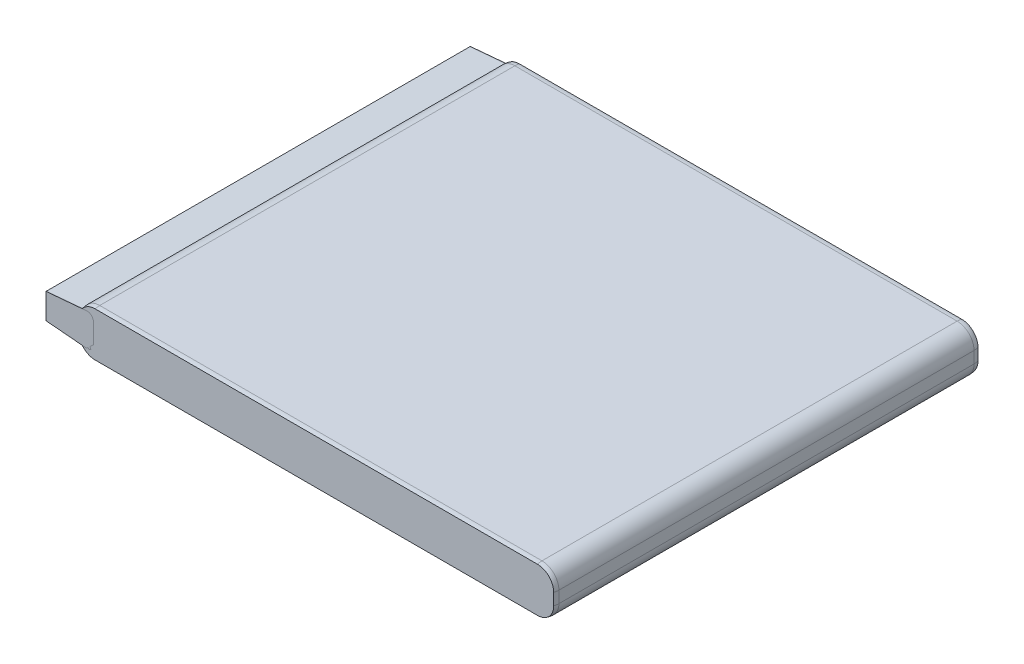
ISO-10303-21;
HEADER;
FILE_DESCRIPTION(('STEP AP214'),'2;1');
FILE_NAME('part.step','',(''),(''),'','','');
FILE_SCHEMA(('AUTOMOTIVE_DESIGN { 1 0 10303 214 1 1 1 1 }'));
ENDSEC;
DATA;
#1=APPLICATION_CONTEXT('core data for automotive mechanical design processes');
#2=APPLICATION_PROTOCOL_DEFINITION('international standard','automotive_design',2000,#1);
#3=PRODUCT_CONTEXT('',#1,'mechanical');
#4=PRODUCT('Part','Part','',(#3));
#5=PRODUCT_RELATED_PRODUCT_CATEGORY('part','',(#4));
#6=PRODUCT_DEFINITION_FORMATION('','',#4);
#7=PRODUCT_DEFINITION_CONTEXT('part definition',#1,'design');
#8=PRODUCT_DEFINITION('design','',#6,#7);
#9=PRODUCT_DEFINITION_SHAPE('','',#8);
#10=(LENGTH_UNIT() NAMED_UNIT(*) SI_UNIT(.MILLI.,.METRE.));
#11=(NAMED_UNIT(*) PLANE_ANGLE_UNIT() SI_UNIT($,.RADIAN.));
#12=(NAMED_UNIT(*) SI_UNIT($,.STERADIAN.) SOLID_ANGLE_UNIT());
#13=UNCERTAINTY_MEASURE_WITH_UNIT(LENGTH_MEASURE(1.E-05),#10,'distance_accuracy_value','');
#14=(GEOMETRIC_REPRESENTATION_CONTEXT(3) GLOBAL_UNCERTAINTY_ASSIGNED_CONTEXT((#13)) GLOBAL_UNIT_ASSIGNED_CONTEXT((#10,
#11,#12)) REPRESENTATION_CONTEXT('',''));
#15=CARTESIAN_POINT('',(0.,0.,0.));
#16=DIRECTION('',(0.,0.,1.));
#17=DIRECTION('',(1.,0.,0.));
#18=AXIS2_PLACEMENT_3D('',#15,#16,#17);
#19=CARTESIAN_POINT('',(-24.25,1.,-26.5));
#20=DIRECTION('',(1.,0.,0.));
#21=DIRECTION('',(0.,1.,0.));
#22=AXIS2_PLACEMENT_3D('',#19,#20,#21);
#23=PLANE('',#22);
#24=DIRECTION('',(0.,-1.,0.));
#25=VECTOR('',#24,1.);
#26=CARTESIAN_POINT('',(-24.25,1.,-25.04));
#27=LINE('',#26,#25);
#28=CARTESIAN_POINT('',(-24.25,1.,-25.04));
#29=VERTEX_POINT('',#28);
#30=CARTESIAN_POINT('',(-24.25,0.,-25.04));
#31=VERTEX_POINT('',#30);
#32=EDGE_CURVE('E71',#29,#31,#27,.T.);
#33=ORIENTED_EDGE('',*,*,#32,.F.);
#34=DIRECTION('',(0.,0.,1.));
#35=VECTOR('',#34,1.);
#36=CARTESIAN_POINT('',(-24.25,1.,-26.5));
#37=LINE('',#36,#35);
#38=CARTESIAN_POINT('',(-24.25,1.,25.04));
#39=VERTEX_POINT('',#38);
#40=EDGE_CURVE('E94',#29,#39,#37,.T.);
#41=ORIENTED_EDGE('',*,*,#40,.T.);
#42=DIRECTION('',(0.,1.,0.));
#43=VECTOR('',#42,1.);
#44=CARTESIAN_POINT('',(-24.25,1.,25.04));
#45=LINE('',#44,#43);
#46=CARTESIAN_POINT('',(-24.25,0.,25.04));
#47=VERTEX_POINT('',#46);
#48=EDGE_CURVE('E88',#47,#39,#45,.T.);
#49=ORIENTED_EDGE('',*,*,#48,.F.);
#50=DIRECTION('',(0.,0.,1.));
#51=VECTOR('',#50,1.);
#52=CARTESIAN_POINT('',(-24.25,0.,-26.5));
#53=LINE('',#52,#51);
#54=EDGE_CURVE('E98',#31,#47,#53,.T.);
#55=ORIENTED_EDGE('',*,*,#54,.F.);
#56=EDGE_LOOP('',(#33,#41,#49,#55));
#57=FACE_BOUND('',#56,.T.);
#58=ADVANCED_FACE('F49',(#57),#23,.T.);
#59=CARTESIAN_POINT('',(-28.5,1.,26.5));
#60=DIRECTION('',(-1.,0.,0.));
#61=DIRECTION('',(0.,0.,1.));
#62=AXIS2_PLACEMENT_3D('',#59,#60,#61);
#63=PLANE('',#62);
#64=DIRECTION('',(0.,1.,0.));
#65=VECTOR('',#64,1.);
#66=CARTESIAN_POINT('',(-28.5,1.,-25.04));
#67=LINE('',#66,#65);
#68=CARTESIAN_POINT('',(-28.5,0.,-25.04));
#69=VERTEX_POINT('',#68);
#70=CARTESIAN_POINT('',(-28.5,1.,-25.04));
#71=VERTEX_POINT('',#70);
#72=EDGE_CURVE('E114',#69,#71,#67,.T.);
#73=ORIENTED_EDGE('',*,*,#72,.F.);
#74=DIRECTION('',(0.,0.,-1.));
#75=VECTOR('',#74,1.);
#76=CARTESIAN_POINT('',(-28.5,0.,26.5));
#77=LINE('',#76,#75);
#78=CARTESIAN_POINT('',(-28.5,0.,25.04));
#79=VERTEX_POINT('',#78);
#80=EDGE_CURVE('E104',#79,#69,#77,.T.);
#81=ORIENTED_EDGE('',*,*,#80,.F.);
#82=DIRECTION('',(0.,-1.,0.));
#83=VECTOR('',#82,1.);
#84=CARTESIAN_POINT('',(-28.5,1.,25.04));
#85=LINE('',#84,#83);
#86=CARTESIAN_POINT('',(-28.5,1.,25.04));
#87=VERTEX_POINT('',#86);
#88=EDGE_CURVE('E64',#87,#79,#85,.T.);
#89=ORIENTED_EDGE('',*,*,#88,.F.);
#90=DIRECTION('',(0.,0.,-1.));
#91=VECTOR('',#90,1.);
#92=CARTESIAN_POINT('',(-28.5,1.,26.5));
#93=LINE('',#92,#91);
#94=EDGE_CURVE('E103',#87,#71,#93,.T.);
#95=ORIENTED_EDGE('',*,*,#94,.T.);
#96=EDGE_LOOP('',(#73,#81,#89,#95));
#97=FACE_BOUND('',#96,.T.);
#98=ADVANCED_FACE('F121',(#97),#63,.T.);
#99=CARTESIAN_POINT('',(-26.375,1.,0.));
#100=DIRECTION('',(0.,1.,0.));
#101=DIRECTION('',(1.,0.,0.));
#102=AXIS2_PLACEMENT_3D('',#99,#100,#101);
#103=PLANE('',#102);
#104=DIRECTION('',(1.,0.,0.));
#105=VECTOR('',#104,1.);
#106=CARTESIAN_POINT('',(-26.375,1.,-25.04));
#107=LINE('',#106,#105);
#108=EDGE_CURVE('E108',#71,#29,#107,.T.);
#109=ORIENTED_EDGE('',*,*,#108,.F.);
#110=ORIENTED_EDGE('',*,*,#94,.F.);
#111=DIRECTION('',(-1.,0.,0.));
#112=VECTOR('',#111,1.);
#113=CARTESIAN_POINT('',(-26.375,1.,25.04));
#114=LINE('',#113,#112);
#115=EDGE_CURVE('E100',#39,#87,#114,.T.);
#116=ORIENTED_EDGE('',*,*,#115,.F.);
#117=ORIENTED_EDGE('',*,*,#40,.F.);
#118=EDGE_LOOP('',(#109,#110,#116,#117));
#119=FACE_BOUND('',#118,.T.);
#120=ADVANCED_FACE('F51',(#119),#103,.T.);
#121=CARTESIAN_POINT('',(-26.375,0.,0.));
#122=DIRECTION('',(0.,-1.,0.));
#123=DIRECTION('',(0.,0.,-1.));
#124=AXIS2_PLACEMENT_3D('',#121,#122,#123);
#125=PLANE('',#124);
#126=DIRECTION('',(-1.,0.,0.));
#127=VECTOR('',#126,1.);
#128=CARTESIAN_POINT('',(-26.375,0.,-25.04));
#129=LINE('',#128,#127);
#130=EDGE_CURVE('E12',#31,#69,#129,.T.);
#131=ORIENTED_EDGE('',*,*,#130,.F.);
#132=ORIENTED_EDGE('',*,*,#54,.T.);
#133=DIRECTION('',(1.,0.,0.));
#134=VECTOR('',#133,1.);
#135=CARTESIAN_POINT('',(-26.375,0.,25.04));
#136=LINE('',#135,#134);
#137=EDGE_CURVE('E57',#79,#47,#136,.T.);
#138=ORIENTED_EDGE('',*,*,#137,.F.);
#139=ORIENTED_EDGE('',*,*,#80,.T.);
#140=EDGE_LOOP('',(#131,#132,#138,#139));
#141=FACE_BOUND('',#140,.T.);
#142=ADVANCED_FACE('F102',(#141),#125,.T.);
#143=CARTESIAN_POINT('',(-38.1921543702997,-2.69,25.04));
#144=DIRECTION('',(0.,0.,-1.));
#145=DIRECTION('',(-1.,0.,0.));
#146=AXIS2_PLACEMENT_3D('',#143,#144,#145);
#147=PLANE('',#146);
#148=ORIENTED_EDGE('',*,*,#115,.T.);
#149=ORIENTED_EDGE('',*,*,#88,.T.);
#150=ORIENTED_EDGE('',*,*,#137,.T.);
#151=ORIENTED_EDGE('',*,*,#48,.T.);
#152=EDGE_LOOP('',(#148,#149,#150,#151));
#153=FACE_BOUND('',#152,.T.);
#154=ADVANCED_FACE('F87',(#153),#147,.F.);
#155=CARTESIAN_POINT('',(-38.1921543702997,-2.69,-25.04));
#156=DIRECTION('',(0.,0.,1.));
#157=DIRECTION('',(1.,0.,0.));
#158=AXIS2_PLACEMENT_3D('',#155,#156,#157);
#159=PLANE('',#158);
#160=ORIENTED_EDGE('',*,*,#108,.T.);
#161=ORIENTED_EDGE('',*,*,#32,.T.);
#162=ORIENTED_EDGE('',*,*,#130,.T.);
#163=ORIENTED_EDGE('',*,*,#72,.T.);
#164=EDGE_LOOP('',(#160,#161,#162,#163));
#165=FACE_BOUND('',#164,.T.);
#166=ADVANCED_FACE('F123',(#165),#159,.F.);
#167=CLOSED_SHELL('',(#58,#98,#120,#142,#154,#166));
#168=MANIFOLD_SOLID_BREP('B2',#167);
#169=CARTESIAN_POINT('',(-28.5,-0.5,-26.5));
#170=DIRECTION('',(-1.,0.,0.));
#171=DIRECTION('',(0.,0.,1.));
#172=AXIS2_PLACEMENT_3D('',#169,#170,#171);
#173=PLANE('',#172);
#174=DIRECTION('',(0.,1.,0.));
#175=VECTOR('',#174,1.);
#176=CARTESIAN_POINT('',(-28.5,-0.5,-25.04));
#177=LINE('',#176,#175);
#178=CARTESIAN_POINT('',(-28.5,-0.5,-25.04));
#179=VERTEX_POINT('',#178);
#180=CARTESIAN_POINT('',(-28.5,0.,-25.04));
#181=VERTEX_POINT('',#180);
#182=EDGE_CURVE('E245',#179,#181,#177,.T.);
#183=ORIENTED_EDGE('',*,*,#182,.F.);
#184=DIRECTION('',(0.,0.,-1.));
#185=VECTOR('',#184,1.);
#186=CARTESIAN_POINT('',(-28.5,-0.5,26.5));
#187=LINE('',#186,#185);
#188=CARTESIAN_POINT('',(-28.5,-0.5,25.04));
#189=VERTEX_POINT('',#188);
#190=EDGE_CURVE('E236',#189,#179,#187,.T.);
#191=ORIENTED_EDGE('',*,*,#190,.F.);
#192=DIRECTION('',(0.,-1.,0.));
#193=VECTOR('',#192,1.);
#194=CARTESIAN_POINT('',(-28.5,-0.5,25.04));
#195=LINE('',#194,#193);
#196=CARTESIAN_POINT('',(-28.5,0.,25.04));
#197=VERTEX_POINT('',#196);
#198=EDGE_CURVE('E197',#197,#189,#195,.T.);
#199=ORIENTED_EDGE('',*,*,#198,.F.);
#200=DIRECTION('',(0.,0.,1.));
#201=VECTOR('',#200,1.);
#202=CARTESIAN_POINT('',(-28.5,0.,26.5));
#203=LINE('',#202,#201);
#204=EDGE_CURVE('E227',#181,#197,#203,.T.);
#205=ORIENTED_EDGE('',*,*,#204,.F.);
#206=EDGE_LOOP('',(#183,#191,#199,#205));
#207=FACE_BOUND('',#206,.T.);
#208=ADVANCED_FACE('F182',(#207),#173,.T.);
#209=CARTESIAN_POINT('',(-24.25,-0.5,26.5));
#210=DIRECTION('',(1.,0.,0.));
#211=DIRECTION('',(0.,1.,0.));
#212=AXIS2_PLACEMENT_3D('',#209,#210,#211);
#213=PLANE('',#212);
#214=DIRECTION('',(0.,-1.,0.));
#215=VECTOR('',#214,1.);
#216=CARTESIAN_POINT('',(-24.25,-0.5,-25.04));
#217=LINE('',#216,#215);
#218=CARTESIAN_POINT('',(-24.25,0.,-25.04));
#219=VERTEX_POINT('',#218);
#220=CARTESIAN_POINT('',(-24.25,-0.5,-25.04));
#221=VERTEX_POINT('',#220);
#222=EDGE_CURVE('E205',#219,#221,#217,.T.);
#223=ORIENTED_EDGE('',*,*,#222,.F.);
#224=DIRECTION('',(0.,0.,-1.));
#225=VECTOR('',#224,1.);
#226=CARTESIAN_POINT('',(-24.25,0.,-26.5));
#227=LINE('',#226,#225);
#228=CARTESIAN_POINT('',(-24.25,0.,25.04));
#229=VERTEX_POINT('',#228);
#230=EDGE_CURVE('E233',#229,#219,#227,.T.);
#231=ORIENTED_EDGE('',*,*,#230,.F.);
#232=DIRECTION('',(0.,1.,0.));
#233=VECTOR('',#232,1.);
#234=CARTESIAN_POINT('',(-24.25,-0.5,25.04));
#235=LINE('',#234,#233);
#236=CARTESIAN_POINT('',(-24.25,-0.5,25.04));
#237=VERTEX_POINT('',#236);
#238=EDGE_CURVE('E221',#237,#229,#235,.T.);
#239=ORIENTED_EDGE('',*,*,#238,.F.);
#240=DIRECTION('',(0.,0.,1.));
#241=VECTOR('',#240,1.);
#242=CARTESIAN_POINT('',(-24.25,-0.5,-26.5));
#243=LINE('',#242,#241);
#244=EDGE_CURVE('E231',#221,#237,#243,.T.);
#245=ORIENTED_EDGE('',*,*,#244,.F.);
#246=EDGE_LOOP('',(#223,#231,#239,#245));
#247=FACE_BOUND('',#246,.T.);
#248=ADVANCED_FACE('F184',(#247),#213,.T.);
#249=CARTESIAN_POINT('',(-26.375,0.,0.));
#250=DIRECTION('',(0.,1.,0.));
#251=DIRECTION('',(1.,0.,0.));
#252=AXIS2_PLACEMENT_3D('',#249,#250,#251);
#253=PLANE('',#252);
#254=DIRECTION('',(1.,0.,0.));
#255=VECTOR('',#254,1.);
#256=CARTESIAN_POINT('',(-26.375,0.,-25.04));
#257=LINE('',#256,#255);
#258=EDGE_CURVE('E239',#181,#219,#257,.T.);
#259=ORIENTED_EDGE('',*,*,#258,.F.);
#260=ORIENTED_EDGE('',*,*,#204,.T.);
#261=DIRECTION('',(-1.,0.,0.));
#262=VECTOR('',#261,1.);
#263=CARTESIAN_POINT('',(-26.375,0.,25.04));
#264=LINE('',#263,#262);
#265=EDGE_CURVE('E248',#229,#197,#264,.T.);
#266=ORIENTED_EDGE('',*,*,#265,.F.);
#267=ORIENTED_EDGE('',*,*,#230,.T.);
#268=EDGE_LOOP('',(#259,#260,#266,#267));
#269=FACE_BOUND('',#268,.T.);
#270=ADVANCED_FACE('F255',(#269),#253,.T.);
#271=CARTESIAN_POINT('',(-26.375,-0.5,0.));
#272=DIRECTION('',(0.,1.,0.));
#273=DIRECTION('',(1.,0.,0.));
#274=AXIS2_PLACEMENT_3D('',#271,#272,#273);
#275=PLANE('',#274);
#276=ORIENTED_EDGE('',*,*,#190,.T.);
#277=DIRECTION('',(1.,0.,0.));
#278=VECTOR('',#277,1.);
#279=CARTESIAN_POINT('',(-26.375,-0.5,-25.04));
#280=LINE('',#279,#278);
#281=EDGE_CURVE('E47',#179,#221,#280,.T.);
#282=ORIENTED_EDGE('',*,*,#281,.T.);
#283=ORIENTED_EDGE('',*,*,#244,.T.);
#284=DIRECTION('',(-1.,0.,0.));
#285=VECTOR('',#284,1.);
#286=CARTESIAN_POINT('',(-26.375,-0.5,25.04));
#287=LINE('',#286,#285);
#288=EDGE_CURVE('E190',#237,#189,#287,.T.);
#289=ORIENTED_EDGE('',*,*,#288,.T.);
#290=EDGE_LOOP('',(#276,#282,#283,#289));
#291=FACE_BOUND('',#290,.T.);
#292=ADVANCED_FACE('F235',(#291),#275,.F.);
#293=CARTESIAN_POINT('',(-38.1921543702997,-2.69,25.04));
#294=DIRECTION('',(0.,0.,-1.));
#295=DIRECTION('',(-1.,0.,0.));
#296=AXIS2_PLACEMENT_3D('',#293,#294,#295);
#297=PLANE('',#296);
#298=ORIENTED_EDGE('',*,*,#265,.T.);
#299=ORIENTED_EDGE('',*,*,#198,.T.);
#300=ORIENTED_EDGE('',*,*,#288,.F.);
#301=ORIENTED_EDGE('',*,*,#238,.T.);
#302=EDGE_LOOP('',(#298,#299,#300,#301));
#303=FACE_BOUND('',#302,.T.);
#304=ADVANCED_FACE('F220',(#303),#297,.F.);
#305=CARTESIAN_POINT('',(-38.1921543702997,-2.69,-25.04));
#306=DIRECTION('',(0.,0.,1.));
#307=DIRECTION('',(1.,0.,0.));
#308=AXIS2_PLACEMENT_3D('',#305,#306,#307);
#309=PLANE('',#308);
#310=ORIENTED_EDGE('',*,*,#258,.T.);
#311=ORIENTED_EDGE('',*,*,#222,.T.);
#312=ORIENTED_EDGE('',*,*,#281,.F.);
#313=ORIENTED_EDGE('',*,*,#182,.T.);
#314=EDGE_LOOP('',(#310,#311,#312,#313));
#315=FACE_BOUND('',#314,.T.);
#316=ADVANCED_FACE('F256',(#315),#309,.F.);
#317=CLOSED_SHELL('',(#208,#248,#270,#292,#304,#316));
#318=MANIFOLD_SOLID_BREP('B6',#317);
#319=CARTESIAN_POINT('',(-24.65,0.,-25.));
#320=DIRECTION('',(-1.,0.,0.));
#321=DIRECTION('',(0.,0.,-1.));
#322=AXIS2_PLACEMENT_3D('',#319,#320,#321);
#323=TOROIDAL_SURFACE('',#322,1.17145513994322,0.75);
#324=CARTESIAN_POINT('',(-24.4535530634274,-1.89484829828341,-25.04));
#325=CARTESIAN_POINT('',(-24.4942015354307,-1.90588101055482,-25.04));
#326=CARTESIAN_POINT('',(-24.5358113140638,-1.9134890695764,-25.04));
#327=CARTESIAN_POINT('',(-24.6197522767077,-1.9216167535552,-25.04));
#328=CARTESIAN_POINT('',(-24.6620842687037,-1.92212783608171,-25.04));
#329=CARTESIAN_POINT('',(-24.7462166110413,-1.91603400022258,-25.04));
#330=CARTESIAN_POINT('',(-24.7880172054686,-1.90943247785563,-25.04));
#331=CARTESIAN_POINT('',(-24.8699052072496,-1.88930690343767,-25.04));
#332=CARTESIAN_POINT('',(-24.9099930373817,-1.87578457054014,-25.04));
#333=CARTESIAN_POINT('',(-24.9873350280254,-1.84220087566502,-25.04));
#334=CARTESIAN_POINT('',(-25.0245888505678,-1.82213873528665,-25.04));
#335=CARTESIAN_POINT('',(-25.0952014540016,-1.77604466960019,-25.04));
#336=CARTESIAN_POINT('',(-25.1285600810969,-1.75001250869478,-25.04));
#337=CARTESIAN_POINT('',(-25.1904373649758,-1.69271551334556,-25.04));
#338=CARTESIAN_POINT('',(-25.2189555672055,-1.66145018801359,-25.04));
#339=CARTESIAN_POINT('',(-25.270339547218,-1.5945765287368,-25.04));
#340=CARTESIAN_POINT('',(-25.2932053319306,-1.55896820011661,-25.04));
#341=CARTESIAN_POINT('',(-25.332641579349,-1.48441055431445,-25.04));
#342=CARTESIAN_POINT('',(-25.3492105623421,-1.44546045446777,-25.04));
#343=CARTESIAN_POINT('',(-25.3755770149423,-1.36533222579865,-25.04));
#344=CARTESIAN_POINT('',(-25.3853744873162,-1.32415409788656,-25.04));
#345=CARTESIAN_POINT('',(-25.3979246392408,-1.24072109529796,-25.04));
#346=CARTESIAN_POINT('',(-25.4006744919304,-1.19846579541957,-25.04));
#347=CARTESIAN_POINT('',(-25.3990457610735,-1.11409284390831,-25.04));
#348=CARTESIAN_POINT('',(-25.3946671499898,-1.07197519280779,-25.04));
#349=CARTESIAN_POINT('',(-25.3789034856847,-0.989044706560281,-25.04));
#350=CARTESIAN_POINT('',(-25.3675140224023,-0.948232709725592,-25.04));
#351=CARTESIAN_POINT('',(-25.3380508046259,-0.869097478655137,-25.04));
#352=CARTESIAN_POINT('',(-25.3199770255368,-0.830774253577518,-25.04));
#353=CARTESIAN_POINT('',(-25.2776418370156,-0.757669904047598,-25.04));
#354=CARTESIAN_POINT('',(-25.2533752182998,-0.722891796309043,-25.04));
#355=CARTESIAN_POINT('',(-25.1993508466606,-0.657899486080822,-25.04));
#356=CARTESIAN_POINT('',(-25.1695930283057,-0.627685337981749,-25.04));
#357=CARTESIAN_POINT('',(-25.1054098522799,-0.572663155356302,-25.04));
#358=CARTESIAN_POINT('',(-25.0709817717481,-0.547858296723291,-25.04));
#359=CARTESIAN_POINT('',(-24.998445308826,-0.504388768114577,-25.04));
#360=CARTESIAN_POINT('',(-24.9603369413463,-0.48572407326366,-25.04));
#361=CARTESIAN_POINT('',(-24.8815735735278,-0.455101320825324,-25.04));
#362=CARTESIAN_POINT('',(-24.8409221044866,-0.443134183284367,-25.04));
#363=CARTESIAN_POINT('',(-24.758183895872,-0.426226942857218,-25.04));
#364=CARTESIAN_POINT('',(-24.7160972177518,-0.421286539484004,-25.04));
#365=CARTESIAN_POINT('',(-24.6318691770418,-0.418589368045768,-25.04));
#366=CARTESIAN_POINT('',(-24.5897287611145,-0.420802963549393,-25.04));
#367=CARTESIAN_POINT('',(-24.5064194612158,-0.432280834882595,-25.04));
#368=CARTESIAN_POINT('',(-24.4652505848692,-0.441545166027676,-25.04));
#369=CARTESIAN_POINT('',(-24.3850841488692,-0.46683513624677,-25.04));
#370=CARTESIAN_POINT('',(-24.3460847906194,-0.482855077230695,-25.04));
#371=CARTESIAN_POINT('',(-24.2713125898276,-0.521188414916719,-25.04));
#372=CARTESIAN_POINT('',(-24.2355398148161,-0.543501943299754,-25.04));
#373=CARTESIAN_POINT('',(-24.1680836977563,-0.593889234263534,-25.04));
#374=CARTESIAN_POINT('',(-24.1364175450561,-0.621986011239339,-25.04));
#375=CARTESIAN_POINT('',(-24.0782385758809,-0.683086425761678,-25.04));
#376=CARTESIAN_POINT('',(-24.0517257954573,-0.716090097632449,-25.04));
#377=CARTESIAN_POINT('',(-24.0045507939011,-0.78614989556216,-25.04));
#378=CARTESIAN_POINT('',(-23.9839016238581,-0.823214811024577,-25.04));
#379=CARTESIAN_POINT('',(-23.9491208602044,-0.900286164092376,-25.04));
#380=CARTESIAN_POINT('',(-23.9349892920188,-0.940292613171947,-25.04));
#381=CARTESIAN_POINT('',(-23.9136512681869,-1.0221001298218,-25.04));
#382=CARTESIAN_POINT('',(-23.9064429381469,-1.06390070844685,-25.04));
#383=CARTESIAN_POINT('',(-23.899152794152,-1.14811887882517,-25.04));
#384=CARTESIAN_POINT('',(-23.8990709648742,-1.19053646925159,-25.04));
#385=CARTESIAN_POINT('',(-23.9060358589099,-1.27474662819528,-25.04));
#386=CARTESIAN_POINT('',(-23.9130766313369,-1.31653968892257,-25.04));
#387=CARTESIAN_POINT('',(-23.9340795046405,-1.39834723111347,-25.04));
#388=CARTESIAN_POINT('',(-23.9480413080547,-1.43836178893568,-25.04));
#389=CARTESIAN_POINT('',(-23.9824765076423,-1.51544454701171,-25.04));
#390=CARTESIAN_POINT('',(-24.0029446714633,-1.55251508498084,-25.04));
#391=CARTESIAN_POINT('',(-24.0498230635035,-1.62270122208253,-25.04));
#392=CARTESIAN_POINT('',(-24.0762347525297,-1.65581584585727,-25.04));
#393=CARTESIAN_POINT('',(-24.1342428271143,-1.71713609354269,-25.04));
#394=CARTESIAN_POINT('',(-24.1658393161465,-1.74534161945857,-25.04));
#395=CARTESIAN_POINT('',(-24.2332972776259,-1.79601713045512,-25.04));
#396=CARTESIAN_POINT('',(-24.2691535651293,-1.818493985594,-25.04));
#397=CARTESIAN_POINT('',(-24.3300174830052,-1.84984969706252,-25.04));
#398=CARTESIAN_POINT('',(-24.3540478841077,-1.86066634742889,-25.04));
#399=CARTESIAN_POINT('',(-24.4031113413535,-1.87971746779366,-25.04));
#400=CARTESIAN_POINT('',(-24.4281443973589,-1.88795193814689,-25.04));
#401=CARTESIAN_POINT('',(-24.4535530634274,-1.89484829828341,-25.04));
#402=B_SPLINE_CURVE_WITH_KNOTS('',3,(#324,#325,#326,#327,#328,#329,#330,#331,#332,#333,#334,
#335,#336,#337,#338,#339,#340,#341,#342,#343,#344,#345,#346,#347,#348,#349,#350,#351,#352,#353,
#354,#355,#356,#357,#358,#359,#360,#361,#362,#363,#364,#365,#366,#367,#368,#369,#370,#371,#372,
#373,#374,#375,#376,#377,#378,#379,#380,#381,#382,#383,#384,#385,#386,#387,#388,#389,#390,#391,
#392,#393,#394,#395,#396,#397,#398,#399,#400,#401),.UNSPECIFIED.,.T.,.F.,(4,2,2,2,2,2,2,2,2,2,2,
2,2,2,2,2,2,2,2,2,2,2,2,2,2,2,2,2,2,2,2,2,2,2,2,2,2,2,4),(0.,0.126261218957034,
0.252674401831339,0.379027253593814,0.505348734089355,0.631685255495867,0.758026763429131,
0.884380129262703,1.0107333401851,1.13711622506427,1.26349905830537,1.38993257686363,
1.51636658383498,1.64288020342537,1.76939428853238,1.89601514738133,2.02263751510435,
2.14933402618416,2.27603002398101,2.40255383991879,2.5290722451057,2.65506720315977,
2.78106314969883,2.90695303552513,3.03284555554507,3.15924910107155,3.28565353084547,
3.41233714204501,3.53902124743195,3.66567104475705,3.79232056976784,3.91886436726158,
4.04540272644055,4.17183958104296,4.29830754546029,4.42477803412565,4.55109613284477,
4.63001987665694,4.70894360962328),.UNSPECIFIED.);
#403=CARTESIAN_POINT('',(-23.8999999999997,-1.17077202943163,-25.04));
#404=VERTEX_POINT('',#403);
#405=CARTESIAN_POINT('',(-24.7153668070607,-1.91818414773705,-25.04));
#406=VERTEX_POINT('',#405);
#407=EDGE_CURVE('E541',#404,#406,#402,.T.);
#408=ORIENTED_EDGE('',*,*,#407,.F.);
#409=CARTESIAN_POINT('',(-23.9,0.,-25.));
#410=DIRECTION('',(-1.,0.,0.));
#411=DIRECTION('',(0.,0.,-1.));
#412=AXIS2_PLACEMENT_3D('',#409,#410,#411);
#413=CIRCLE('',#412,1.17145513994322);
#414=CARTESIAN_POINT('',(-23.9,-1.17145513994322,-25.));
#415=VERTEX_POINT('',#414);
#416=EDGE_CURVE('E444',#404,#415,#413,.T.);
#417=ORIENTED_EDGE('',*,*,#416,.T.);
#418=CARTESIAN_POINT('',(-24.65,-1.17145513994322,-25.));
#419=DIRECTION('',(0.,0.,-1.));
#420=DIRECTION('',(1.,0.,0.));
#421=AXIS2_PLACEMENT_3D('',#418,#419,#420);
#422=CIRCLE('',#421,0.75);
#423=CARTESIAN_POINT('',(-24.7153668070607,-1.91860116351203,-25.));
#424=VERTEX_POINT('',#423);
#425=EDGE_CURVE('E441',#415,#424,#422,.T.);
#426=ORIENTED_EDGE('',*,*,#425,.T.);
#427=CARTESIAN_POINT('',(-24.7153668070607,0.,-25.));
#428=DIRECTION('',(1.,0.,0.));
#429=DIRECTION('',(0.,0.,-1.));
#430=AXIS2_PLACEMENT_3D('',#427,#428,#429);
#431=CIRCLE('',#430,1.91860116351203);
#432=EDGE_CURVE('E445',#424,#406,#431,.T.);
#433=ORIENTED_EDGE('',*,*,#432,.T.);
#434=EDGE_LOOP('',(#408,#417,#426,#433));
#435=FACE_BOUND('',#434,.T.);
#436=ADVANCED_FACE('F314',(#435),#323,.T.);
#437=CARTESIAN_POINT('',(-24.65,0.,25.));
#438=DIRECTION('',(-1.,0.,0.));
#439=DIRECTION('',(0.,0.,1.));
#440=AXIS2_PLACEMENT_3D('',#437,#438,#439);
#441=TOROIDAL_SURFACE('',#440,1.17145513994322,0.75);
#442=CARTESIAN_POINT('',(-24.4535530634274,-1.89484829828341,25.04));
#443=CARTESIAN_POINT('',(-24.4129008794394,-1.88381070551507,25.04));
#444=CARTESIAN_POINT('',(-24.3731512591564,-1.86933165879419,25.04));
#445=CARTESIAN_POINT('',(-24.2966145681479,-1.83389237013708,25.04));
#446=CARTESIAN_POINT('',(-24.2598311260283,-1.81292433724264,25.04));
#447=CARTESIAN_POINT('',(-24.1903219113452,-1.76511765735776,25.04));
#448=CARTESIAN_POINT('',(-24.157594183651,-1.73828185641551,25.04));
#449=CARTESIAN_POINT('',(-24.097117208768,-1.67950439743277,25.04));
#450=CARTESIAN_POINT('',(-24.0693667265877,-1.64756400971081,25.04));
#451=CARTESIAN_POINT('',(-24.0196133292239,-1.57947100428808,25.04));
#452=CARTESIAN_POINT('',(-23.9976117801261,-1.54331738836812,25.04));
#453=CARTESIAN_POINT('',(-23.9599876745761,-1.46782908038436,25.04));
#454=CARTESIAN_POINT('',(-23.9443653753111,-1.42849426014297,25.04));
#455=CARTESIAN_POINT('',(-23.9199387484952,-1.34774877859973,25.04));
#456=CARTESIAN_POINT('',(-23.9111364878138,-1.30633749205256,25.04));
#457=CARTESIAN_POINT('',(-23.9006054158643,-1.22262524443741,25.04));
#458=CARTESIAN_POINT('',(-23.8988766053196,-1.18032428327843,25.04));
#459=CARTESIAN_POINT('',(-23.9025398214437,-1.09600954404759,25.04));
#460=CARTESIAN_POINT('',(-23.9079356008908,-1.05399592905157,25.04));
#461=CARTESIAN_POINT('',(-23.9256985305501,-0.971469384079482,25.04));
#462=CARTESIAN_POINT('',(-23.9380656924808,-0.930956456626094,25.04));
#463=CARTESIAN_POINT('',(-23.9694300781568,-0.852547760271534,25.04));
#464=CARTESIAN_POINT('',(-23.9884323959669,-0.814654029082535,25.04));
#465=CARTESIAN_POINT('',(-24.0325240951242,-0.742590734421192,25.04));
#466=CARTESIAN_POINT('',(-24.0576135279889,-0.708421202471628,25.04));
#467=CARTESIAN_POINT('',(-24.1131904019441,-0.644747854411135,25.04));
#468=CARTESIAN_POINT('',(-24.1436822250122,-0.615247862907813,25.04));
#469=CARTESIAN_POINT('',(-24.2091868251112,-0.561786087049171,25.04));
#470=CARTESIAN_POINT('',(-24.2441996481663,-0.537824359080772,25.04));
#471=CARTESIAN_POINT('',(-24.3177472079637,-0.496132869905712,25.04));
#472=CARTESIAN_POINT('',(-24.3562811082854,-0.478401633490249,25.04));
#473=CARTESIAN_POINT('',(-24.435784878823,-0.449683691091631,25.04));
#474=CARTESIAN_POINT('',(-24.4767546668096,-0.438696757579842,25.04));
#475=CARTESIAN_POINT('',(-24.5598269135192,-0.423822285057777,25.04));
#476=CARTESIAN_POINT('',(-24.6019252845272,-0.419911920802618,25.04));
#477=CARTESIAN_POINT('',(-24.686178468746,-0.419240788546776,25.04));
#478=CARTESIAN_POINT('',(-24.7283332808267,-0.422479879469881,25.04));
#479=CARTESIAN_POINT('',(-24.8113604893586,-0.435985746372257,25.04));
#480=CARTESIAN_POINT('',(-24.8522365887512,-0.44622978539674,25.04));
#481=CARTESIAN_POINT('',(-24.9316972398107,-0.473415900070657,25.04));
#482=CARTESIAN_POINT('',(-24.9702817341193,-0.49035814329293,25.04));
#483=CARTESIAN_POINT('',(-25.0441788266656,-0.530503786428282,25.04));
#484=CARTESIAN_POINT('',(-25.0794822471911,-0.553724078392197,25.04));
#485=CARTESIAN_POINT('',(-25.1457080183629,-0.605742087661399,25.04));
#486=CARTESIAN_POINT('',(-25.1766303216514,-0.634539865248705,25.04));
#487=CARTESIAN_POINT('',(-25.2333254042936,-0.697010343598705,25.04));
#488=CARTESIAN_POINT('',(-25.2590796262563,-0.730699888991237,25.04));
#489=CARTESIAN_POINT('',(-25.3045702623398,-0.801922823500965,25.04));
#490=CARTESIAN_POINT('',(-25.3243066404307,-0.839456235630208,25.04));
#491=CARTESIAN_POINT('',(-25.3572081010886,-0.917324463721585,25.04));
#492=CARTESIAN_POINT('',(-25.3703696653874,-0.957660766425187,25.04));
#493=CARTESIAN_POINT('',(-25.3897283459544,-1.03997137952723,25.04));
#494=CARTESIAN_POINT('',(-25.3959254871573,-1.0819456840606,25.04));
#495=CARTESIAN_POINT('',(-25.4011741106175,-1.16630655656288,25.04));
#496=CARTESIAN_POINT('',(-25.400231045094,-1.20869278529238,25.04));
#497=CARTESIAN_POINT('',(-25.3912363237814,-1.29270426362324,25.04));
#498=CARTESIAN_POINT('',(-25.383184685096,-1.3343295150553,25.04));
#499=CARTESIAN_POINT('',(-25.3602089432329,-1.41560215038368,25.04));
#500=CARTESIAN_POINT('',(-25.3452903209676,-1.4552510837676,25.04));
#501=CARTESIAN_POINT('',(-25.3090046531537,-1.53147954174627,25.04));
#502=CARTESIAN_POINT('',(-25.2876376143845,-1.56805906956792,25.04));
#503=CARTESIAN_POINT('',(-25.2390744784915,-1.63708958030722,25.04));
#504=CARTESIAN_POINT('',(-25.2118815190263,-1.66954277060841,25.04));
#505=CARTESIAN_POINT('',(-25.1524324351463,-1.72941993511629,25.04));
#506=CARTESIAN_POINT('',(-25.120176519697,-1.75684411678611,25.04));
#507=CARTESIAN_POINT('',(-25.0515325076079,-1.80587418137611,25.04));
#508=CARTESIAN_POINT('',(-25.0151462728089,-1.82748267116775,25.04));
#509=CARTESIAN_POINT('',(-24.9392516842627,-1.86428804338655,25.04));
#510=CARTESIAN_POINT('',(-24.8997425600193,-1.87948333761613,25.04));
#511=CARTESIAN_POINT('',(-24.818726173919,-1.903026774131,25.04));
#512=CARTESIAN_POINT('',(-24.7772183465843,-1.91137296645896,25.04));
#513=CARTESIAN_POINT('',(-24.6934250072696,-1.92096441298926,25.04));
#514=CARTESIAN_POINT('',(-24.6511404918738,-1.92221820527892,25.04));
#515=CARTESIAN_POINT('',(-24.5828074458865,-1.91848668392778,25.04));
#516=CARTESIAN_POINT('',(-24.5566219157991,-1.91566651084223,25.04));
#517=CARTESIAN_POINT('',(-24.5046912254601,-1.90729458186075,25.04));
#518=CARTESIAN_POINT('',(-24.4789460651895,-1.90174282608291,25.04));
#519=CARTESIAN_POINT('',(-24.4535530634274,-1.89484829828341,25.04));
#520=B_SPLINE_CURVE_WITH_KNOTS('',3,(#442,#443,#444,#445,#446,#447,#448,#449,#450,#451,#452,
#453,#454,#455,#456,#457,#458,#459,#460,#461,#462,#463,#464,#465,#466,#467,#468,#469,#470,#471,
#472,#473,#474,#475,#476,#477,#478,#479,#480,#481,#482,#483,#484,#485,#486,#487,#488,#489,#490,
#491,#492,#493,#494,#495,#496,#497,#498,#499,#500,#501,#502,#503,#504,#505,#506,#507,#508,#509,
#510,#511,#512,#513,#514,#515,#516,#517,#518,#519),.UNSPECIFIED.,.T.,.F.,(4,2,2,2,2,2,2,2,2,2,2,
2,2,2,2,2,2,2,2,2,2,2,2,2,2,2,2,2,2,2,2,2,2,2,2,2,2,2,4),(0.,0.126275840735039,
0.252703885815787,0.379070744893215,0.505406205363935,0.631771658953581,0.758142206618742,
0.88455103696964,1.01095988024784,1.13743533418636,1.26391100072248,1.39048398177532,
1.51705803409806,1.64373522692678,1.77041370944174,1.89706217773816,2.02370637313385,
2.14994134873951,2.27617383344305,2.40199852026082,2.52782635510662,2.65399617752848,
2.78016736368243,2.90678379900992,3.03340099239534,3.16008586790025,3.28677028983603,
3.41335798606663,3.53994537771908,3.66643190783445,3.79291830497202,3.91933675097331,
4.04574998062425,4.17210645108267,4.2984941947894,4.42491790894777,4.55118939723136,
4.63006640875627,4.70894341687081),.UNSPECIFIED.);
#521=CARTESIAN_POINT('',(-24.7153668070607,-1.91818414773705,25.04));
#522=VERTEX_POINT('',#521);
#523=CARTESIAN_POINT('',(-23.9,-1.1707720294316,25.04));
#524=VERTEX_POINT('',#523);
#525=EDGE_CURVE('E592',#522,#524,#520,.T.);
#526=ORIENTED_EDGE('',*,*,#525,.F.);
#527=CARTESIAN_POINT('',(-24.7153668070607,0.,25.));
#528=DIRECTION('',(1.,0.,0.));
#529=DIRECTION('',(0.,0.,1.));
#530=AXIS2_PLACEMENT_3D('',#527,#528,#529);
#531=CIRCLE('',#530,1.91860116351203);
#532=CARTESIAN_POINT('',(-24.7153668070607,-1.91860116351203,25.));
#533=VERTEX_POINT('',#532);
#534=EDGE_CURVE('E434',#522,#533,#531,.T.);
#535=ORIENTED_EDGE('',*,*,#534,.T.);
#536=CARTESIAN_POINT('',(-24.65,-1.17145513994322,25.));
#537=DIRECTION('',(0.,0.,-1.));
#538=DIRECTION('',(1.,0.,0.));
#539=AXIS2_PLACEMENT_3D('',#536,#537,#538);
#540=CIRCLE('',#539,0.75);
#541=CARTESIAN_POINT('',(-23.9,-1.17145513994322,25.));
#542=VERTEX_POINT('',#541);
#543=EDGE_CURVE('E429',#542,#533,#540,.T.);
#544=ORIENTED_EDGE('',*,*,#543,.F.);
#545=CARTESIAN_POINT('',(-23.9,0.,25.));
#546=DIRECTION('',(-1.,0.,0.));
#547=DIRECTION('',(0.,0.,1.));
#548=AXIS2_PLACEMENT_3D('',#545,#546,#547);
#549=CIRCLE('',#548,1.17145513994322);
#550=EDGE_CURVE('E431',#542,#524,#549,.T.);
#551=ORIENTED_EDGE('',*,*,#550,.T.);
#552=EDGE_LOOP('',(#526,#535,#544,#551));
#553=FACE_BOUND('',#552,.T.);
#554=ADVANCED_FACE('F514',(#553),#441,.T.);
#555=CARTESIAN_POINT('',(-29.5,0.,-25.));
#556=DIRECTION('',(1.,0.,0.));
#557=DIRECTION('',(0.,0.707106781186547,-0.707106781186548));
#558=AXIS2_PLACEMENT_3D('',#555,#556,#557);
#559=CONICAL_SURFACE('',#558,1.5,0.0872664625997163);
#560=CARTESIAN_POINT('',(-31.7550310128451,-1.30209610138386,-25.04));
#561=CARTESIAN_POINT('',(-30.9592244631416,-1.37175301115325,-25.04));
#562=CARTESIAN_POINT('',(-30.1634174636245,-1.44140478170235,-25.04));
#563=CARTESIAN_POINT('',(-29.2156479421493,-1.52435289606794,-25.04));
#564=CARTESIAN_POINT('',(-29.0636856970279,-1.53765240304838,-25.04));
#565=CARTESIAN_POINT('',(-27.9639537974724,-1.63389850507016,-25.04));
#566=CARTESIAN_POINT('',(-27.0161837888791,-1.71684105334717,-25.04));
#567=CARTESIAN_POINT('',(-22.2399574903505,-2.13480882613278,-25.04));
#568=CARTESIAN_POINT('',(-18.4114970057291,-2.46978611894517,-25.04));
#569=CARTESIAN_POINT('',(-14.5830379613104,-2.80477985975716,-25.04));
#570=B_SPLINE_CURVE_WITH_KNOTS('',3,(#560,#561,#562,#563,#564,#565,#566,#567,#568,#569),
.UNSPECIFIED.,.F.,.F.,(4,2,2,2,4),(0.,2.39654779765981,2.85417713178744,5.70835426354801,
17.2376159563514),.UNSPECIFIED.);
#571=CARTESIAN_POINT('',(-29.5,-1.49946657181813,-25.04));
#572=VERTEX_POINT('',#571);
#573=EDGE_CURVE('E328',#406,#572,#570,.F.);
#574=ORIENTED_EDGE('',*,*,#573,.F.);
#575=ORIENTED_EDGE('',*,*,#432,.F.);
#576=DIRECTION('',(-0.996194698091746,0.0871557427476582,0.));
#577=VECTOR('',#576,1.);
#578=CARTESIAN_POINT('',(-29.5,-1.5,-25.));
#579=LINE('',#578,#577);
#580=CARTESIAN_POINT('',(-29.5,-1.5,-25.));
#581=VERTEX_POINT('',#580);
#582=EDGE_CURVE('E452',#424,#581,#579,.T.);
#583=ORIENTED_EDGE('',*,*,#582,.T.);
#584=CARTESIAN_POINT('',(-29.5,0.,-25.));
#585=DIRECTION('',(1.,0.,0.));
#586=DIRECTION('',(0.,0.707106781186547,-0.707106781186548));
#587=AXIS2_PLACEMENT_3D('',#584,#585,#586);
#588=CIRCLE('',#587,1.5);
#589=EDGE_CURVE('E453',#581,#572,#588,.T.);
#590=ORIENTED_EDGE('',*,*,#589,.T.);
#591=EDGE_LOOP('',(#574,#575,#583,#590));
#592=FACE_BOUND('',#591,.T.);
#593=ADVANCED_FACE('F523',(#592),#559,.T.);
#594=CARTESIAN_POINT('',(-29.5,0.,25.));
#595=DIRECTION('',(1.,0.,0.));
#596=DIRECTION('',(0.,-0.707106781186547,0.707106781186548));
#597=AXIS2_PLACEMENT_3D('',#594,#595,#596);
#598=CONICAL_SURFACE('',#597,1.5,0.0872664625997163);
#599=CARTESIAN_POINT('',(-31.7550310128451,-1.30209610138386,25.04));
#600=CARTESIAN_POINT('',(-30.9592244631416,-1.37175301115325,25.04));
#601=CARTESIAN_POINT('',(-30.1634174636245,-1.44140478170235,25.04));
#602=CARTESIAN_POINT('',(-29.2156479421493,-1.52435289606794,25.04));
#603=CARTESIAN_POINT('',(-29.0636856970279,-1.53765240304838,25.04));
#604=CARTESIAN_POINT('',(-27.9639537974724,-1.63389850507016,25.04));
#605=CARTESIAN_POINT('',(-27.0161837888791,-1.71684105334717,25.04));
#606=CARTESIAN_POINT('',(-22.2399574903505,-2.13480882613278,25.04));
#607=CARTESIAN_POINT('',(-18.4114970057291,-2.46978611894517,25.04));
#608=CARTESIAN_POINT('',(-14.5830379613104,-2.80477985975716,25.04));
#609=B_SPLINE_CURVE_WITH_KNOTS('',3,(#599,#600,#601,#602,#603,#604,#605,#606,#607,#608),
.UNSPECIFIED.,.F.,.F.,(4,2,2,2,4),(0.,2.39654779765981,2.85417713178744,5.70835426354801,
17.2376159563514),.UNSPECIFIED.);
#610=CARTESIAN_POINT('',(-29.5,-1.49946657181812,25.04));
#611=VERTEX_POINT('',#610);
#612=EDGE_CURVE('E322',#611,#522,#609,.T.);
#613=ORIENTED_EDGE('',*,*,#612,.F.);
#614=CARTESIAN_POINT('',(-29.5,0.,25.));
#615=DIRECTION('',(1.,0.,0.));
#616=DIRECTION('',(0.,0.707106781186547,0.707106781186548));
#617=AXIS2_PLACEMENT_3D('',#614,#615,#616);
#618=CIRCLE('',#617,1.5);
#619=CARTESIAN_POINT('',(-29.5,-1.5,25.));
#620=VERTEX_POINT('',#619);
#621=EDGE_CURVE('E417',#611,#620,#618,.T.);
#622=ORIENTED_EDGE('',*,*,#621,.T.);
#623=DIRECTION('',(0.996194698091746,-0.0871557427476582,0.));
#624=VECTOR('',#623,1.);
#625=CARTESIAN_POINT('',(-29.5,-1.5,25.));
#626=LINE('',#625,#624);
#627=EDGE_CURVE('E426',#620,#533,#626,.T.);
#628=ORIENTED_EDGE('',*,*,#627,.T.);
#629=ORIENTED_EDGE('',*,*,#534,.F.);
#630=EDGE_LOOP('',(#613,#622,#628,#629));
#631=FACE_BOUND('',#630,.T.);
#632=ADVANCED_FACE('F490',(#631),#598,.T.);
#633=CARTESIAN_POINT('',(-24.5235888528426,0.430330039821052,-25.04));
#634=CARTESIAN_POINT('',(-24.5649336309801,0.423231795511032,-25.04));
#635=CARTESIAN_POINT('',(-24.6069072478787,0.419617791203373,-25.04));
#636=CARTESIAN_POINT('',(-24.6908990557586,0.419489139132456,-25.04));
#637=CARTESIAN_POINT('',(-24.7329172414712,0.422982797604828,-25.04));
#638=CARTESIAN_POINT('',(-24.8157540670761,0.436970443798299,-25.04));
#639=CARTESIAN_POINT('',(-24.8565732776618,0.447461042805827,-25.04));
#640=CARTESIAN_POINT('',(-24.9358690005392,0.47512427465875,-25.04));
#641=CARTESIAN_POINT('',(-24.9743460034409,0.492295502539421,-25.04));
#642=CARTESIAN_POINT('',(-25.0479990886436,0.532881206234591,-25.04));
#643=CARTESIAN_POINT('',(-25.0831652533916,0.556313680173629,-25.04));
#644=CARTESIAN_POINT('',(-25.1490839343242,0.608731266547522,-25.04));
#645=CARTESIAN_POINT('',(-25.1798362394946,0.637716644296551,-25.04));
#646=CARTESIAN_POINT('',(-25.2361593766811,0.700530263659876,-25.04));
#647=CARTESIAN_POINT('',(-25.261711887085,0.734374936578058,-25.04));
#648=CARTESIAN_POINT('',(-25.3067755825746,0.805872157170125,-25.04));
#649=CARTESIAN_POINT('',(-25.326286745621,0.843524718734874,-25.04));
#650=CARTESIAN_POINT('',(-25.358719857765,0.92159032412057,-25.04));
#651=CARTESIAN_POINT('',(-25.3716385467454,0.962004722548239,-25.04));
#652=CARTESIAN_POINT('',(-25.3905017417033,1.04442958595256,-25.04));
#653=CARTESIAN_POINT('',(-25.3964462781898,1.0864400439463,-25.04));
#654=CARTESIAN_POINT('',(-25.4011873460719,1.17082995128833,-25.04));
#655=CARTESIAN_POINT('',(-25.3999893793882,1.21320909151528,-25.04));
#656=CARTESIAN_POINT('',(-25.3904896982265,1.29716363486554,-25.04));
#657=CARTESIAN_POINT('',(-25.3821880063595,1.33873904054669,-25.04));
#658=CARTESIAN_POINT('',(-25.3587242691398,1.4198709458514,-25.04));
#659=CARTESIAN_POINT('',(-25.3435676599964,1.45942901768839,-25.04));
#660=CARTESIAN_POINT('',(-25.3068247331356,1.53543698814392,-25.04));
#661=CARTESIAN_POINT('',(-25.2852384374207,1.5718868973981,-25.04));
#662=CARTESIAN_POINT('',(-25.236262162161,1.64062279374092,-25.04));
#663=CARTESIAN_POINT('',(-25.2088753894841,1.67291106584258,-25.04));
#664=CARTESIAN_POINT('',(-25.1490681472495,1.73242950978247,-25.04));
#665=CARTESIAN_POINT('',(-25.1166476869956,1.75965969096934,-25.04));
#666=CARTESIAN_POINT('',(-25.0477054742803,1.8082794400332,-25.04));
#667=CARTESIAN_POINT('',(-25.0111851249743,1.82967099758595,-25.04));
#668=CARTESIAN_POINT('',(-24.9350709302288,1.86601789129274,-25.04));
#669=CARTESIAN_POINT('',(-24.8954770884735,1.88097323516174,-25.04));
#670=CARTESIAN_POINT('',(-24.8143480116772,1.90402044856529,-25.04));
#671=CARTESIAN_POINT('',(-24.7728131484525,1.91211362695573,-25.04));
#672=CARTESIAN_POINT('',(-24.6889742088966,1.9212113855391,-25.04));
#673=CARTESIAN_POINT('',(-24.646670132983,1.92221596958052,-25.04));
#674=CARTESIAN_POINT('',(-24.5624972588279,1.91710820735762,-25.04));
#675=CARTESIAN_POINT('',(-24.5206284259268,1.91099643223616,-25.04));
#676=CARTESIAN_POINT('',(-24.438511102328,1.89183053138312,-25.04));
#677=CARTESIAN_POINT('',(-24.3982626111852,1.87877640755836,-25.04));
#678=CARTESIAN_POINT('',(-24.3205278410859,1.84609643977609,-25.04));
#679=CARTESIAN_POINT('',(-24.28304159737,1.82647051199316,-25.04));
#680=CARTESIAN_POINT('',(-24.211895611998,1.78120445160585,-25.04));
#681=CARTESIAN_POINT('',(-24.178235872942,1.7555643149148,-25.04));
#682=CARTESIAN_POINT('',(-24.1156942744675,1.69899492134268,-25.04));
#683=CARTESIAN_POINT('',(-24.0868129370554,1.66806508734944,-25.04));
#684=CARTESIAN_POINT('',(-24.034651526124,1.60179665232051,-25.04));
#685=CARTESIAN_POINT('',(-24.0113714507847,1.56645805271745,-25.04));
#686=CARTESIAN_POINT('',(-23.9710673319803,1.4923668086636,-25.04));
#687=CARTESIAN_POINT('',(-23.9540447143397,1.45361338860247,-25.04));
#688=CARTESIAN_POINT('',(-23.9267444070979,1.37379944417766,-25.04));
#689=CARTESIAN_POINT('',(-23.9164667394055,1.33273891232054,-25.04));
#690=CARTESIAN_POINT('',(-23.9029432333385,1.24945927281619,-25.04));
#691=CARTESIAN_POINT('',(-23.8997001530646,1.20723971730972,-25.04));
#692=CARTESIAN_POINT('',(-23.9003434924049,1.12285497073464,-25.04));
#693=CARTESIAN_POINT('',(-23.9042299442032,1.08068977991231,-25.04));
#694=CARTESIAN_POINT('',(-23.9190240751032,0.997581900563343,-25.04));
#695=CARTESIAN_POINT('',(-23.9299362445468,0.95664001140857,-25.04));
#696=CARTESIAN_POINT('',(-23.9584731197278,0.877168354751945,-25.04));
#697=CARTESIAN_POINT('',(-23.9760975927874,0.838638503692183,-25.04));
#698=CARTESIAN_POINT('',(-24.0175721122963,0.765052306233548,-25.04));
#699=CARTESIAN_POINT('',(-24.0414267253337,0.729998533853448,-25.04));
#700=CARTESIAN_POINT('',(-24.0946861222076,0.664380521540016,-25.04));
#701=CARTESIAN_POINT('',(-24.1240923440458,0.633817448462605,-25.04));
#702=CARTESIAN_POINT('',(-24.1876478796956,0.578030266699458,-25.04));
#703=CARTESIAN_POINT('',(-24.2218023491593,0.552812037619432,-25.04));
#704=CARTESIAN_POINT('',(-24.2938388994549,0.508501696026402,-25.04));
#705=CARTESIAN_POINT('',(-24.3317164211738,0.4894022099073,-25.04));
#706=CARTESIAN_POINT('',(-24.3954944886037,0.463737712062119,-25.04));
#707=CARTESIAN_POINT('',(-24.4206024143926,0.455153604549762,-25.04));
#708=CARTESIAN_POINT('',(-24.4715861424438,0.440692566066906,-25.04));
#709=CARTESIAN_POINT('',(-24.497461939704,0.434815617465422,-25.04));
#710=CARTESIAN_POINT('',(-24.5235888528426,0.430330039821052,-25.04));
#711=B_SPLINE_CURVE_WITH_KNOTS('',3,(#633,#634,#635,#636,#637,#638,#639,#640,#641,#642,#643,
#644,#645,#646,#647,#648,#649,#650,#651,#652,#653,#654,#655,#656,#657,#658,#659,#660,#661,#662,
#663,#664,#665,#666,#667,#668,#669,#670,#671,#672,#673,#674,#675,#676,#677,#678,#679,#680,#681,
#682,#683,#684,#685,#686,#687,#688,#689,#690,#691,#692,#693,#694,#695,#696,#697,#698,#699,#700,
#701,#702,#703,#704,#705,#706,#707,#708,#709,#710),.UNSPECIFIED.,.T.,.F.,(4,2,2,2,2,2,2,2,2,2,2,
2,2,2,2,2,2,2,2,2,2,2,2,2,2,2,2,2,2,2,2,2,2,2,2,2,2,2,4),(0.,0.125752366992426,
0.251651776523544,0.377490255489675,0.503302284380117,0.629479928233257,0.75566360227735,
0.882284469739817,1.00890579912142,1.13558968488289,1.26227301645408,1.38885877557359,
1.51544413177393,1.64192927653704,1.76841398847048,1.89482895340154,2.02124368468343,
2.14761528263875,2.27398672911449,2.40033406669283,2.52668133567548,2.65301846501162,
2.77935555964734,2.90569426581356,3.03203305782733,3.15838564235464,3.28473818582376,
3.41111950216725,3.53750122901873,3.66393249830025,3.79036433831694,3.91687706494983,
4.04338540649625,4.16998673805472,4.29662090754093,4.42339366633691,4.55001307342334,
4.62948000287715,4.70894641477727),.UNSPECIFIED.);
#712=CARTESIAN_POINT('',(-24.7153668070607,1.91818414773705,-25.04));
#713=VERTEX_POINT('',#712);
#714=CARTESIAN_POINT('',(-23.9,1.1707720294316,-25.04));
#715=VERTEX_POINT('',#714);
#716=EDGE_CURVE('E536',#713,#715,#711,.T.);
#717=ORIENTED_EDGE('',*,*,#716,.F.);
#718=CARTESIAN_POINT('',(-24.7153668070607,1.91860116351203,-25.));
#719=VERTEX_POINT('',#718);
#720=EDGE_CURVE('E458',#713,#719,#431,.T.);
#721=ORIENTED_EDGE('',*,*,#720,.T.);
#722=CARTESIAN_POINT('',(-24.65,1.17145513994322,-25.));
#723=DIRECTION('',(0.,0.,-1.));
#724=DIRECTION('',(-0.087155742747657,0.996194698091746,0.));
#725=AXIS2_PLACEMENT_3D('',#722,#723,#724);
#726=CIRCLE('',#725,0.75);
#727=CARTESIAN_POINT('',(-23.9,1.17145513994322,-25.));
#728=VERTEX_POINT('',#727);
#729=EDGE_CURVE('E408',#719,#728,#726,.T.);
#730=ORIENTED_EDGE('',*,*,#729,.T.);
#731=EDGE_CURVE('E461',#728,#715,#413,.T.);
#732=ORIENTED_EDGE('',*,*,#731,.T.);
#733=EDGE_LOOP('',(#717,#721,#730,#732));
#734=FACE_BOUND('',#733,.T.);
#735=ADVANCED_FACE('F519',(#734),#323,.T.);
#736=CARTESIAN_POINT('',(-24.65,-1.17145513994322,13.25));
#737=DIRECTION('',(0.,0.,1.));
#738=DIRECTION('',(0.675590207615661,-0.737277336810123,0.));
#739=AXIS2_PLACEMENT_3D('',#736,#737,#738);
#740=CYLINDRICAL_SURFACE('',#739,0.75);
#741=ORIENTED_EDGE('',*,*,#543,.T.);
#742=DIRECTION('',(0.,0.,-1.));
#743=VECTOR('',#742,1.);
#744=CARTESIAN_POINT('',(-24.7153668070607,-1.91860116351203,13.25));
#745=LINE('',#744,#743);
#746=EDGE_CURVE('E438',#533,#424,#745,.T.);
#747=ORIENTED_EDGE('',*,*,#746,.T.);
#748=ORIENTED_EDGE('',*,*,#425,.F.);
#749=DIRECTION('',(0.,0.,1.));
#750=VECTOR('',#749,1.);
#751=CARTESIAN_POINT('',(-23.9,-1.17145513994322,13.25));
#752=LINE('',#751,#750);
#753=EDGE_CURVE('E436',#415,#542,#752,.T.);
#754=ORIENTED_EDGE('',*,*,#753,.T.);
#755=EDGE_LOOP('',(#741,#747,#748,#754));
#756=FACE_BOUND('',#755,.T.);
#757=ADVANCED_FACE('F512',(#756),#740,.T.);
#758=CARTESIAN_POINT('',(-24.5235888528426,0.430330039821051,25.04));
#759=CARTESIAN_POINT('',(-24.4821472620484,0.437448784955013,25.04));
#760=CARTESIAN_POINT('',(-24.4412776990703,0.448078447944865,25.04));
#761=CARTESIAN_POINT('',(-24.3618676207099,0.476053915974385,25.04));
#762=CARTESIAN_POINT('',(-24.3233300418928,0.493407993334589,25.04));
#763=CARTESIAN_POINT('',(-24.2497038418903,0.534326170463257,25.04));
#764=CARTESIAN_POINT('',(-24.2146151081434,0.557890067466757,25.04));
#765=CARTESIAN_POINT('',(-24.1488836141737,0.61054867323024,25.04));
#766=CARTESIAN_POINT('',(-24.1182397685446,0.639642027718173,25.04));
#767=CARTESIAN_POINT('',(-24.0621467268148,0.702655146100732,25.04));
#768=CARTESIAN_POINT('',(-24.036716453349,0.736591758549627,25.04));
#769=CARTESIAN_POINT('',(-23.9919100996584,0.808252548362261,25.04));
#770=CARTESIAN_POINT('',(-23.9725342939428,0.845976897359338,25.04));
#771=CARTESIAN_POINT('',(-23.9403831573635,0.924160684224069,25.04));
#772=CARTESIAN_POINT('',(-23.9276107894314,0.964621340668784,25.04));
#773=CARTESIAN_POINT('',(-23.9090459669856,1.04711347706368,25.04));
#774=CARTESIAN_POINT('',(-23.9032534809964,1.08914494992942,25.04));
#775=CARTESIAN_POINT('',(-23.8988177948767,1.1735509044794,25.04));
#776=CARTESIAN_POINT('',(-23.9001690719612,1.21592509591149,25.04));
#777=CARTESIAN_POINT('',(-23.90997234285,1.29984392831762,25.04));
#778=CARTESIAN_POINT('',(-23.918424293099,1.34138857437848,25.04));
#779=CARTESIAN_POINT('',(-23.9421811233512,1.42243430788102,25.04));
#780=CARTESIAN_POINT('',(-23.9574805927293,1.46193698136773,25.04));
#781=CARTESIAN_POINT('',(-23.9944979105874,1.53781101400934,25.04));
#782=CARTESIAN_POINT('',(-24.0162157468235,1.57418237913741,25.04));
#783=CARTESIAN_POINT('',(-24.0654400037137,1.6427403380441,25.04));
#784=CARTESIAN_POINT('',(-24.0929432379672,1.67492921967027,25.04));
#785=CARTESIAN_POINT('',(-24.1529650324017,1.73423072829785,25.04));
#786=CARTESIAN_POINT('',(-24.1854835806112,1.76134336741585,25.04));
#787=CARTESIAN_POINT('',(-24.2546008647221,1.80971333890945,25.04));
#788=CARTESIAN_POINT('',(-24.2911982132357,1.83097265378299,25.04));
#789=CARTESIAN_POINT('',(-24.3674431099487,1.86704402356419,25.04));
#790=CARTESIAN_POINT('',(-24.4070906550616,1.8818560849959,25.04));
#791=CARTESIAN_POINT('',(-24.4883023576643,1.90460980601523,25.04));
#792=CARTESIAN_POINT('',(-24.5298661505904,1.91255276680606,25.04));
#793=CARTESIAN_POINT('',(-24.6137373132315,1.92134737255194,25.04));
#794=CARTESIAN_POINT('',(-24.6560446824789,1.92219902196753,25.04));
#795=CARTESIAN_POINT('',(-24.7401984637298,1.91678702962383,25.04));
#796=CARTESIAN_POINT('',(-24.7820449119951,1.9105239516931,25.04));
#797=CARTESIAN_POINT('',(-24.8640923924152,1.89106135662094,25.04));
#798=CARTESIAN_POINT('',(-24.9042934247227,1.8778618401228,25.04));
#799=CARTESIAN_POINT('',(-24.98190959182,1.84490110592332,25.04));
#800=CARTESIAN_POINT('',(-25.0193246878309,1.82513979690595,25.04));
#801=CARTESIAN_POINT('',(-25.0903066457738,1.77961685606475,25.04));
#802=CARTESIAN_POINT('',(-25.1238735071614,1.75385522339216,25.04));
#803=CARTESIAN_POINT('',(-25.1862102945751,1.69706013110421,25.04));
#804=CARTESIAN_POINT('',(-25.2149796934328,1.66602609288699,25.04));
#805=CARTESIAN_POINT('',(-25.2669013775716,1.59956947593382,25.04));
#806=CARTESIAN_POINT('',(-25.2900536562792,1.56414689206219,25.04));
#807=CARTESIAN_POINT('',(-25.330089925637,1.48991022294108,25.04));
#808=CARTESIAN_POINT('',(-25.3469724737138,1.45109535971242,25.04));
#809=CARTESIAN_POINT('',(-25.373984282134,1.37118302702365,25.04));
#810=CARTESIAN_POINT('',(-25.3841135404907,1.33008555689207,25.04));
#811=CARTESIAN_POINT('',(-25.3973361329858,1.24675730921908,25.04));
#812=CARTESIAN_POINT('',(-25.4004266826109,1.20452608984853,25.04));
#813=CARTESIAN_POINT('',(-25.3994785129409,1.12014376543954,25.04));
#814=CARTESIAN_POINT('',(-25.3954397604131,1.07799266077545,25.04));
#815=CARTESIAN_POINT('',(-25.3803455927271,0.994939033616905,25.04));
#816=CARTESIAN_POINT('',(-25.3692858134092,0.954037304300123,25.04));
#817=CARTESIAN_POINT('',(-25.3404621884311,0.874668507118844,25.04));
#818=CARTESIAN_POINT('',(-25.3226983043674,0.8362014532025,25.04));
#819=CARTESIAN_POINT('',(-25.2809543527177,0.762758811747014,25.04));
#820=CARTESIAN_POINT('',(-25.2569689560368,0.727786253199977,25.04));
#821=CARTESIAN_POINT('',(-25.2034713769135,0.662361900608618,25.04));
#822=CARTESIAN_POINT('',(-25.1739593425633,0.631909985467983,25.04));
#823=CARTESIAN_POINT('',(-25.1102278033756,0.576376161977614,25.04));
#824=CARTESIAN_POINT('',(-25.076005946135,0.55129695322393,25.04));
#825=CARTESIAN_POINT('',(-25.0038234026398,0.507241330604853,25.04));
#826=CARTESIAN_POINT('',(-24.9658618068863,0.488266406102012,25.04));
#827=CARTESIAN_POINT('',(-24.8873201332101,0.456994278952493,25.04));
#828=CARTESIAN_POINT('',(-24.8467421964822,0.444691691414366,25.04));
#829=CARTESIAN_POINT('',(-24.7641262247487,0.427122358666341,25.04));
#830=CARTESIAN_POINT('',(-24.7220900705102,0.421846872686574,25.04));
#831=CARTESIAN_POINT('',(-24.653792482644,0.419102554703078,25.04));
#832=CARTESIAN_POINT('',(-24.6276002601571,0.419430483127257,25.04));
#833=CARTESIAN_POINT('',(-24.5753944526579,0.422828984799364,25.04));
#834=CARTESIAN_POINT('',(-24.5493808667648,0.425899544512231,25.04));
#835=CARTESIAN_POINT('',(-24.5235888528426,0.430330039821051,25.04));
#836=B_SPLINE_CURVE_WITH_KNOTS('',3,(#758,#759,#760,#761,#762,#763,#764,#765,#766,#767,#768,
#769,#770,#771,#772,#773,#774,#775,#776,#777,#778,#779,#780,#781,#782,#783,#784,#785,#786,#787,
#788,#789,#790,#791,#792,#793,#794,#795,#796,#797,#798,#799,#800,#801,#802,#803,#804,#805,#806,
#807,#808,#809,#810,#811,#812,#813,#814,#815,#816,#817,#818,#819,#820,#821,#822,#823,#824,#825,
#826,#827,#828,#829,#830,#831,#832,#833,#834,#835),.UNSPECIFIED.,.T.,.F.,(4,2,2,2,2,2,2,2,2,2,2,
2,2,2,2,2,2,2,2,2,2,2,2,2,2,2,2,2,2,2,2,2,2,2,2,2,2,2,4),(0.,0.126050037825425,
0.252255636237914,0.378457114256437,0.504627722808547,0.631248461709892,0.757874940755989,
0.884558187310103,1.01124086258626,1.13782561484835,1.26440959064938,1.39089372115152,
1.51737761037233,1.64379201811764,1.77020612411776,1.89657736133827,2.02294847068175,
2.14929563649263,2.27564272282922,2.40197979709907,2.5283168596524,2.65465568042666,
2.78099451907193,2.9073472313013,3.03370009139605,3.16008200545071,3.28646395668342,
3.41289589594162,3.53932842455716,3.66583961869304,3.79235153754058,3.91897218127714,
4.04558943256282,4.17227015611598,4.29898176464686,4.42559095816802,4.55204251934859,
4.63049270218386,4.70894249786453),.UNSPECIFIED.);
#837=CARTESIAN_POINT('',(-23.9,1.1707720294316,25.04));
#838=VERTEX_POINT('',#837);
#839=CARTESIAN_POINT('',(-24.7153668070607,1.91818414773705,25.04));
#840=VERTEX_POINT('',#839);
#841=EDGE_CURVE('E336',#838,#840,#836,.T.);
#842=ORIENTED_EDGE('',*,*,#841,.F.);
#843=CARTESIAN_POINT('',(-23.9,1.17145513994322,25.));
#844=VERTEX_POINT('',#843);
#845=EDGE_CURVE('E435',#838,#844,#549,.T.);
#846=ORIENTED_EDGE('',*,*,#845,.T.);
#847=CARTESIAN_POINT('',(-24.65,1.17145513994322,25.));
#848=DIRECTION('',(0.,0.,1.));
#849=DIRECTION('',(1.,0.,0.));
#850=AXIS2_PLACEMENT_3D('',#847,#848,#849);
#851=CIRCLE('',#850,0.75);
#852=CARTESIAN_POINT('',(-24.7153668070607,1.91860116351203,25.));
#853=VERTEX_POINT('',#852);
#854=EDGE_CURVE('E439',#844,#853,#851,.T.);
#855=ORIENTED_EDGE('',*,*,#854,.T.);
#856=EDGE_CURVE('E465',#853,#840,#531,.T.);
#857=ORIENTED_EDGE('',*,*,#856,.T.);
#858=EDGE_LOOP('',(#842,#846,#855,#857));
#859=FACE_BOUND('',#858,.T.);
#860=ADVANCED_FACE('F505',(#859),#441,.T.);
#861=CARTESIAN_POINT('',(-24.65,1.17145513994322,13.25));
#862=DIRECTION('',(0.,0.,-1.));
#863=DIRECTION('',(0.675590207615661,0.737277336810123,0.));
#864=AXIS2_PLACEMENT_3D('',#861,#862,#863);
#865=CYLINDRICAL_SURFACE('',#864,0.75);
#866=ORIENTED_EDGE('',*,*,#729,.F.);
#867=DIRECTION('',(0.,0.,1.));
#868=VECTOR('',#867,1.);
#869=CARTESIAN_POINT('',(-24.7153668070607,1.91860116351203,13.25));
#870=LINE('',#869,#868);
#871=EDGE_CURVE('E467',#719,#853,#870,.T.);
#872=ORIENTED_EDGE('',*,*,#871,.T.);
#873=ORIENTED_EDGE('',*,*,#854,.F.);
#874=DIRECTION('',(0.,0.,-1.));
#875=VECTOR('',#874,1.);
#876=CARTESIAN_POINT('',(-23.9,1.17145513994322,13.25));
#877=LINE('',#876,#875);
#878=EDGE_CURVE('E451',#844,#728,#877,.T.);
#879=ORIENTED_EDGE('',*,*,#878,.T.);
#880=EDGE_LOOP('',(#866,#872,#873,#879));
#881=FACE_BOUND('',#880,.T.);
#882=ADVANCED_FACE('F503',(#881),#865,.T.);
#883=CARTESIAN_POINT('',(-27.1091327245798,1.70917378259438,0.));
#884=DIRECTION('',(-0.0871557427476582,0.996194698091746,0.));
#885=DIRECTION('',(0.,0.,1.));
#886=AXIS2_PLACEMENT_3D('',#883,#884,#885);
#887=PLANE('',#886);
#888=ORIENTED_EDGE('',*,*,#871,.F.);
#889=DIRECTION('',(0.996194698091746,0.0871557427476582,0.));
#890=VECTOR('',#889,1.);
#891=CARTESIAN_POINT('',(-29.5,1.5,-25.));
#892=LINE('',#891,#890);
#893=CARTESIAN_POINT('',(-29.5,1.5,-25.));
#894=VERTEX_POINT('',#893);
#895=EDGE_CURVE('E424',#894,#719,#892,.T.);
#896=ORIENTED_EDGE('',*,*,#895,.F.);
#897=DIRECTION('',(0.,0.,1.));
#898=VECTOR('',#897,1.);
#899=CARTESIAN_POINT('',(-29.5,1.5,26.5));
#900=LINE('',#899,#898);
#901=CARTESIAN_POINT('',(-29.5,1.5,25.));
#902=VERTEX_POINT('',#901);
#903=EDGE_CURVE('E449',#894,#902,#900,.T.);
#904=ORIENTED_EDGE('',*,*,#903,.T.);
#905=DIRECTION('',(-0.996194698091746,-0.0871557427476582,0.));
#906=VECTOR('',#905,1.);
#907=CARTESIAN_POINT('',(-29.5,1.5,25.));
#908=LINE('',#907,#906);
#909=EDGE_CURVE('E421',#853,#902,#908,.T.);
#910=ORIENTED_EDGE('',*,*,#909,.F.);
#911=EDGE_LOOP('',(#888,#896,#904,#910));
#912=FACE_BOUND('',#911,.T.);
#913=ADVANCED_FACE('F316',(#912),#887,.T.);
#914=CARTESIAN_POINT('',(-31.7550310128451,1.30209610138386,-25.04));
#915=CARTESIAN_POINT('',(-30.9592244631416,1.37175301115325,-25.04));
#916=CARTESIAN_POINT('',(-30.1634174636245,1.44140478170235,-25.04));
#917=CARTESIAN_POINT('',(-29.2156479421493,1.52435289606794,-25.04));
#918=CARTESIAN_POINT('',(-29.0636856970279,1.53765240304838,-25.04));
#919=CARTESIAN_POINT('',(-27.9639537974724,1.63389850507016,-25.04));
#920=CARTESIAN_POINT('',(-27.0161837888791,1.71684105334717,-25.04));
#921=CARTESIAN_POINT('',(-22.2399574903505,2.13480882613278,-25.04));
#922=CARTESIAN_POINT('',(-18.4114970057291,2.46978611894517,-25.04));
#923=CARTESIAN_POINT('',(-14.5830379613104,2.80477985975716,-25.04));
#924=B_SPLINE_CURVE_WITH_KNOTS('',3,(#914,#915,#916,#917,#918,#919,#920,#921,#922,#923),
.UNSPECIFIED.,.F.,.F.,(4,2,2,2,4),(0.,2.39654779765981,2.85417713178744,5.70835426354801,
17.2376159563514),.UNSPECIFIED.);
#925=CARTESIAN_POINT('',(-29.5,1.49946657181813,-25.04));
#926=VERTEX_POINT('',#925);
#927=EDGE_CURVE('E545',#926,#713,#924,.T.);
#928=ORIENTED_EDGE('',*,*,#927,.F.);
#929=EDGE_CURVE('E448',#926,#894,#588,.T.);
#930=ORIENTED_EDGE('',*,*,#929,.T.);
#931=ORIENTED_EDGE('',*,*,#895,.T.);
#932=ORIENTED_EDGE('',*,*,#720,.F.);
#933=EDGE_LOOP('',(#928,#930,#931,#932));
#934=FACE_BOUND('',#933,.T.);
#935=ADVANCED_FACE('F491',(#934),#559,.T.);
#936=CARTESIAN_POINT('',(-23.9,0.,26.5));
#937=DIRECTION('',(1.,0.,0.));
#938=DIRECTION('',(0.,1.,0.));
#939=AXIS2_PLACEMENT_3D('',#936,#937,#938);
#940=PLANE('',#939);
#941=DIRECTION('',(0.,-1.,0.));
#942=VECTOR('',#941,1.);
#943=CARTESIAN_POINT('',(-23.9,0.,-25.04));
#944=LINE('',#943,#942);
#945=EDGE_CURVE('E471',#715,#404,#944,.T.);
#946=ORIENTED_EDGE('',*,*,#945,.F.);
#947=ORIENTED_EDGE('',*,*,#731,.F.);
#948=ORIENTED_EDGE('',*,*,#878,.F.);
#949=ORIENTED_EDGE('',*,*,#845,.F.);
#950=DIRECTION('',(0.,1.,0.));
#951=VECTOR('',#950,1.);
#952=CARTESIAN_POINT('',(-23.9,0.,25.04));
#953=LINE('',#952,#951);
#954=EDGE_CURVE('E593',#524,#838,#953,.T.);
#955=ORIENTED_EDGE('',*,*,#954,.F.);
#956=ORIENTED_EDGE('',*,*,#550,.F.);
#957=ORIENTED_EDGE('',*,*,#753,.F.);
#958=ORIENTED_EDGE('',*,*,#416,.F.);
#959=EDGE_LOOP('',(#946,#947,#948,#949,#955,#956,#957,#958));
#960=FACE_BOUND('',#959,.T.);
#961=ADVANCED_FACE('F497',(#960),#940,.T.);
#962=CARTESIAN_POINT('',(-29.5,0.,-26.5));
#963=DIRECTION('',(-1.,0.,0.));
#964=DIRECTION('',(0.,0.,1.));
#965=AXIS2_PLACEMENT_3D('',#962,#963,#964);
#966=PLANE('',#965);
#967=DIRECTION('',(0.,1.,0.));
#968=VECTOR('',#967,1.);
#969=CARTESIAN_POINT('',(-29.5,0.,-25.04));
#970=LINE('',#969,#968);
#971=EDGE_CURVE('E180',#572,#926,#970,.T.);
#972=ORIENTED_EDGE('',*,*,#971,.F.);
#973=ORIENTED_EDGE('',*,*,#589,.F.);
#974=DIRECTION('',(0.,0.,-1.));
#975=VECTOR('',#974,1.);
#976=CARTESIAN_POINT('',(-29.5,-1.5,26.5));
#977=LINE('',#976,#975);
#978=EDGE_CURVE('E469',#620,#581,#977,.T.);
#979=ORIENTED_EDGE('',*,*,#978,.F.);
#980=ORIENTED_EDGE('',*,*,#621,.F.);
#981=DIRECTION('',(0.,-1.,0.));
#982=VECTOR('',#981,1.);
#983=CARTESIAN_POINT('',(-29.5,0.,25.04));
#984=LINE('',#983,#982);
#985=CARTESIAN_POINT('',(-29.5,1.49946657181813,25.04));
#986=VERTEX_POINT('',#985);
#987=EDGE_CURVE('E402',#986,#611,#984,.T.);
#988=ORIENTED_EDGE('',*,*,#987,.F.);
#989=EDGE_CURVE('E415',#902,#986,#618,.T.);
#990=ORIENTED_EDGE('',*,*,#989,.F.);
#991=ORIENTED_EDGE('',*,*,#903,.F.);
#992=ORIENTED_EDGE('',*,*,#929,.F.);
#993=EDGE_LOOP('',(#972,#973,#979,#980,#988,#990,#991,#992));
#994=FACE_BOUND('',#993,.T.);
#995=ADVANCED_FACE('F413',(#994),#966,.T.);
#996=CARTESIAN_POINT('',(-31.7550310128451,1.30209610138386,25.04));
#997=CARTESIAN_POINT('',(-30.9592244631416,1.37175301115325,25.04));
#998=CARTESIAN_POINT('',(-30.1634174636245,1.44140478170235,25.04));
#999=CARTESIAN_POINT('',(-29.2156479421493,1.52435289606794,25.04));
#1000=CARTESIAN_POINT('',(-29.0636856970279,1.53765240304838,25.04));
#1001=CARTESIAN_POINT('',(-27.9639537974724,1.63389850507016,25.04));
#1002=CARTESIAN_POINT('',(-27.0161837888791,1.71684105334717,25.04));
#1003=CARTESIAN_POINT('',(-22.2399574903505,2.13480882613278,25.04));
#1004=CARTESIAN_POINT('',(-18.4114970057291,2.46978611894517,25.04));
#1005=CARTESIAN_POINT('',(-14.5830379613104,2.80477985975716,25.04));
#1006=B_SPLINE_CURVE_WITH_KNOTS('',3,(#996,#997,#998,#999,#1000,#1001,#1002,#1003,#1004,#1005),
.UNSPECIFIED.,.F.,.F.,(4,2,2,2,4),(0.,2.39654779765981,2.85417713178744,5.70835426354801,
17.2376159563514),.UNSPECIFIED.);
#1007=EDGE_CURVE('E399',#840,#986,#1006,.F.);
#1008=ORIENTED_EDGE('',*,*,#1007,.F.);
#1009=ORIENTED_EDGE('',*,*,#856,.F.);
#1010=ORIENTED_EDGE('',*,*,#909,.T.);
#1011=ORIENTED_EDGE('',*,*,#989,.T.);
#1012=EDGE_LOOP('',(#1008,#1009,#1010,#1011));
#1013=FACE_BOUND('',#1012,.T.);
#1014=ADVANCED_FACE('F419',(#1013),#598,.T.);
#1015=CARTESIAN_POINT('',(-27.1091327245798,-1.70917378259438,0.));
#1016=DIRECTION('',(-0.0871557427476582,-0.996194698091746,0.));
#1017=DIRECTION('',(-0.996194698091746,0.0871557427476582,0.));
#1018=AXIS2_PLACEMENT_3D('',#1015,#1016,#1017);
#1019=PLANE('',#1018);
#1020=ORIENTED_EDGE('',*,*,#746,.F.);
#1021=ORIENTED_EDGE('',*,*,#627,.F.);
#1022=ORIENTED_EDGE('',*,*,#978,.T.);
#1023=ORIENTED_EDGE('',*,*,#582,.F.);
#1024=EDGE_LOOP('',(#1020,#1021,#1022,#1023));
#1025=FACE_BOUND('',#1024,.T.);
#1026=ADVANCED_FACE('F489',(#1025),#1019,.T.);
#1027=CARTESIAN_POINT('',(-38.1921543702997,-2.69,25.04));
#1028=DIRECTION('',(0.,0.,-1.));
#1029=DIRECTION('',(-1.,0.,0.));
#1030=AXIS2_PLACEMENT_3D('',#1027,#1028,#1029);
#1031=PLANE('',#1030);
#1032=ORIENTED_EDGE('',*,*,#525,.T.);
#1033=ORIENTED_EDGE('',*,*,#954,.T.);
#1034=ORIENTED_EDGE('',*,*,#841,.T.);
#1035=ORIENTED_EDGE('',*,*,#1007,.T.);
#1036=ORIENTED_EDGE('',*,*,#987,.T.);
#1037=ORIENTED_EDGE('',*,*,#612,.T.);
#1038=EDGE_LOOP('',(#1032,#1033,#1034,#1035,#1036,#1037));
#1039=FACE_BOUND('',#1038,.T.);
#1040=ADVANCED_FACE('F401',(#1039),#1031,.F.);
#1041=CARTESIAN_POINT('',(-38.1921543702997,-2.69,-25.04));
#1042=DIRECTION('',(0.,0.,1.));
#1043=DIRECTION('',(1.,0.,0.));
#1044=AXIS2_PLACEMENT_3D('',#1041,#1042,#1043);
#1045=PLANE('',#1044);
#1046=ORIENTED_EDGE('',*,*,#945,.T.);
#1047=ORIENTED_EDGE('',*,*,#407,.T.);
#1048=ORIENTED_EDGE('',*,*,#573,.T.);
#1049=ORIENTED_EDGE('',*,*,#971,.T.);
#1050=ORIENTED_EDGE('',*,*,#927,.T.);
#1051=ORIENTED_EDGE('',*,*,#716,.T.);
#1052=EDGE_LOOP('',(#1046,#1047,#1048,#1049,#1050,#1051));
#1053=FACE_BOUND('',#1052,.T.);
#1054=ADVANCED_FACE('F576',(#1053),#1045,.F.);
#1055=CLOSED_SHELL('',(#436,#554,#593,#632,#735,#757,#860,#882,#913,#935,#961,#995,#1014,#1026,
#1040,#1054));
#1056=MANIFOLD_SOLID_BREP('B41',#1055);
#1057=CARTESIAN_POINT('',(28.5,0.69,-24.5));
#1058=DIRECTION('',(-0.408248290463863,-0.408248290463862,-0.816496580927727));
#1059=DIRECTION('',(0.577350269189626,0.577350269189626,-0.577350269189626));
#1060=AXIS2_PLACEMENT_3D('',#1057,#1058,#1059);
#1061=SPHERICAL_SURFACE('',#1060,2.);
#1062=CARTESIAN_POINT('',(28.5,0.69,-25.04));
#1063=DIRECTION('',(0.,0.,1.));
#1064=DIRECTION('',(1.,0.,0.));
#1065=AXIS2_PLACEMENT_3D('',#1062,#1063,#1064);
#1066=CIRCLE('',#1065,1.92572064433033);
#1067=CARTESIAN_POINT('',(28.5,2.61572064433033,-25.04));
#1068=VERTEX_POINT('',#1067);
#1069=CARTESIAN_POINT('',(30.4257206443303,0.69,-25.04));
#1070=VERTEX_POINT('',#1069);
#1071=EDGE_CURVE('E818',#1068,#1070,#1066,.F.);
#1072=ORIENTED_EDGE('',*,*,#1071,.F.);
#1073=CARTESIAN_POINT('',(28.5,0.69,-24.5));
#1074=DIRECTION('',(-1.,0.,0.));
#1075=DIRECTION('',(0.,1.,0.));
#1076=AXIS2_PLACEMENT_3D('',#1073,#1074,#1075);
#1077=CIRCLE('',#1076,2.);
#1078=CARTESIAN_POINT('',(28.5,2.69,-24.5));
#1079=VERTEX_POINT('',#1078);
#1080=EDGE_CURVE('E828',#1079,#1068,#1077,.T.);
#1081=ORIENTED_EDGE('',*,*,#1080,.F.);
#1082=CARTESIAN_POINT('',(28.5,0.69,-24.5));
#1083=DIRECTION('',(0.,0.,1.));
#1084=DIRECTION('',(1.,0.,0.));
#1085=AXIS2_PLACEMENT_3D('',#1082,#1083,#1084);
#1086=CIRCLE('',#1085,2.);
#1087=CARTESIAN_POINT('',(30.5,0.69,-24.5));
#1088=VERTEX_POINT('',#1087);
#1089=EDGE_CURVE('E837',#1088,#1079,#1086,.T.);
#1090=ORIENTED_EDGE('',*,*,#1089,.F.);
#1091=CARTESIAN_POINT('',(28.5,0.69,-24.5));
#1092=DIRECTION('',(0.,-1.,0.));
#1093=DIRECTION('',(0.,0.,-1.));
#1094=AXIS2_PLACEMENT_3D('',#1091,#1092,#1093);
#1095=CIRCLE('',#1094,2.);
#1096=EDGE_CURVE('E830',#1070,#1088,#1095,.T.);
#1097=ORIENTED_EDGE('',*,*,#1096,.F.);
#1098=EDGE_LOOP('',(#1072,#1081,#1090,#1097));
#1099=FACE_BOUND('',#1098,.T.);
#1100=ADVANCED_FACE('F707',(#1099),#1061,.T.);
#1101=CARTESIAN_POINT('',(28.5,0.69,24.5));
#1102=DIRECTION('',(0.408248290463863,-0.816496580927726,0.408248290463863));
#1103=DIRECTION('',(0.577350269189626,0.577350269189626,0.577350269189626));
#1104=AXIS2_PLACEMENT_3D('',#1101,#1102,#1103);
#1105=SPHERICAL_SURFACE('',#1104,2.);
#1106=CARTESIAN_POINT('',(28.5,0.69,25.04));
#1107=DIRECTION('',(0.,0.,-1.));
#1108=DIRECTION('',(-1.,0.,0.));
#1109=AXIS2_PLACEMENT_3D('',#1106,#1107,#1108);
#1110=CIRCLE('',#1109,1.92572064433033);
#1111=CARTESIAN_POINT('',(30.4257206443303,0.69,25.04));
#1112=VERTEX_POINT('',#1111);
#1113=CARTESIAN_POINT('',(28.5,2.61572064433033,25.04));
#1114=VERTEX_POINT('',#1113);
#1115=EDGE_CURVE('E721',#1112,#1114,#1110,.F.);
#1116=ORIENTED_EDGE('',*,*,#1115,.F.);
#1117=CARTESIAN_POINT('',(28.5,0.69,24.5));
#1118=DIRECTION('',(0.,-1.,0.));
#1119=DIRECTION('',(1.,0.,0.));
#1120=AXIS2_PLACEMENT_3D('',#1117,#1118,#1119);
#1121=CIRCLE('',#1120,2.);
#1122=CARTESIAN_POINT('',(30.5,0.69,24.5));
#1123=VERTEX_POINT('',#1122);
#1124=EDGE_CURVE('E922',#1123,#1112,#1121,.T.);
#1125=ORIENTED_EDGE('',*,*,#1124,.F.);
#1126=CARTESIAN_POINT('',(28.5,0.69,24.5));
#1127=DIRECTION('',(0.,0.,-1.));
#1128=DIRECTION('',(0.,1.,0.));
#1129=AXIS2_PLACEMENT_3D('',#1126,#1127,#1128);
#1130=CIRCLE('',#1129,2.);
#1131=CARTESIAN_POINT('',(28.5,2.69,24.5));
#1132=VERTEX_POINT('',#1131);
#1133=EDGE_CURVE('E873',#1132,#1123,#1130,.T.);
#1134=ORIENTED_EDGE('',*,*,#1133,.F.);
#1135=CARTESIAN_POINT('',(28.5,0.69,24.5));
#1136=DIRECTION('',(-1.,0.,0.));
#1137=DIRECTION('',(0.,0.,1.));
#1138=AXIS2_PLACEMENT_3D('',#1135,#1136,#1137);
#1139=CIRCLE('',#1138,2.);
#1140=EDGE_CURVE('E912',#1114,#1132,#1139,.T.);
#1141=ORIENTED_EDGE('',*,*,#1140,.F.);
#1142=EDGE_LOOP('',(#1116,#1125,#1134,#1141));
#1143=FACE_BOUND('',#1142,.T.);
#1144=ADVANCED_FACE('F1000',(#1143),#1105,.T.);
#1145=CARTESIAN_POINT('',(-23.7,0.69,-24.5));
#1146=DIRECTION('',(0.408248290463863,-0.408248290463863,-0.816496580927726));
#1147=DIRECTION('',(-0.577350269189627,0.577350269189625,-0.577350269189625));
#1148=AXIS2_PLACEMENT_3D('',#1145,#1146,#1147);
#1149=SPHERICAL_SURFACE('',#1148,2.);
#1150=CARTESIAN_POINT('',(-23.7,0.69,-25.04));
#1151=DIRECTION('',(0.,0.,1.));
#1152=DIRECTION('',(1.,0.,0.));
#1153=AXIS2_PLACEMENT_3D('',#1150,#1151,#1152);
#1154=CIRCLE('',#1153,1.92572064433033);
#1155=CARTESIAN_POINT('',(-25.6257206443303,0.69,-25.04));
#1156=VERTEX_POINT('',#1155);
#1157=CARTESIAN_POINT('',(-23.7,2.61572064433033,-25.04));
#1158=VERTEX_POINT('',#1157);
#1159=EDGE_CURVE('E729',#1156,#1158,#1154,.F.);
#1160=ORIENTED_EDGE('',*,*,#1159,.F.);
#1161=CARTESIAN_POINT('',(-23.7,0.69,-24.5));
#1162=DIRECTION('',(0.,-1.,0.));
#1163=DIRECTION('',(-1.,0.,0.));
#1164=AXIS2_PLACEMENT_3D('',#1161,#1162,#1163);
#1165=CIRCLE('',#1164,2.);
#1166=CARTESIAN_POINT('',(-25.7,0.69,-24.5));
#1167=VERTEX_POINT('',#1166);
#1168=EDGE_CURVE('E846',#1167,#1156,#1165,.T.);
#1169=ORIENTED_EDGE('',*,*,#1168,.F.);
#1170=CARTESIAN_POINT('',(-23.7,0.69,-24.5));
#1171=DIRECTION('',(0.,0.,1.));
#1172=DIRECTION('',(0.,1.,0.));
#1173=AXIS2_PLACEMENT_3D('',#1170,#1171,#1172);
#1174=CIRCLE('',#1173,2.);
#1175=CARTESIAN_POINT('',(-23.7,2.69,-24.5));
#1176=VERTEX_POINT('',#1175);
#1177=EDGE_CURVE('E874',#1176,#1167,#1174,.T.);
#1178=ORIENTED_EDGE('',*,*,#1177,.F.);
#1179=CARTESIAN_POINT('',(-23.7,0.69,-24.5));
#1180=DIRECTION('',(1.,0.,0.));
#1181=DIRECTION('',(0.,0.,-1.));
#1182=AXIS2_PLACEMENT_3D('',#1179,#1180,#1181);
#1183=CIRCLE('',#1182,2.);
#1184=EDGE_CURVE('E839',#1158,#1176,#1183,.T.);
#1185=ORIENTED_EDGE('',*,*,#1184,.F.);
#1186=EDGE_LOOP('',(#1160,#1169,#1178,#1185));
#1187=FACE_BOUND('',#1186,.T.);
#1188=ADVANCED_FACE('F1025',(#1187),#1149,.T.);
#1189=CARTESIAN_POINT('',(28.5,-0.69,-24.5));
#1190=DIRECTION('',(-0.408248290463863,0.408248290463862,-0.816496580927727));
#1191=DIRECTION('',(0.577350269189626,-0.577350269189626,-0.577350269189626));
#1192=AXIS2_PLACEMENT_3D('',#1189,#1190,#1191);
#1193=SPHERICAL_SURFACE('',#1192,2.);
#1194=CARTESIAN_POINT('',(28.5,-0.69,-25.04));
#1195=DIRECTION('',(0.,0.,1.));
#1196=DIRECTION('',(1.,0.,0.));
#1197=AXIS2_PLACEMENT_3D('',#1194,#1195,#1196);
#1198=CIRCLE('',#1197,1.92572064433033);
#1199=CARTESIAN_POINT('',(30.4257206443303,-0.69,-25.04));
#1200=VERTEX_POINT('',#1199);
#1201=CARTESIAN_POINT('',(28.5,-2.61572064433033,-25.04));
#1202=VERTEX_POINT('',#1201);
#1203=EDGE_CURVE('E979',#1200,#1202,#1198,.F.);
#1204=ORIENTED_EDGE('',*,*,#1203,.F.);
#1205=CARTESIAN_POINT('',(28.5,-0.69,-24.5));
#1206=DIRECTION('',(0.,1.,0.));
#1207=DIRECTION('',(1.,0.,0.));
#1208=AXIS2_PLACEMENT_3D('',#1205,#1206,#1207);
#1209=CIRCLE('',#1208,2.);
#1210=CARTESIAN_POINT('',(30.5,-0.69,-24.5));
#1211=VERTEX_POINT('',#1210);
#1212=EDGE_CURVE('E823',#1211,#1200,#1209,.T.);
#1213=ORIENTED_EDGE('',*,*,#1212,.F.);
#1214=CARTESIAN_POINT('',(28.5,-0.69,-24.5));
#1215=DIRECTION('',(0.,0.,1.));
#1216=DIRECTION('',(0.,-1.,0.));
#1217=AXIS2_PLACEMENT_3D('',#1214,#1215,#1216);
#1218=CIRCLE('',#1217,2.);
#1219=CARTESIAN_POINT('',(28.5,-2.69,-24.5));
#1220=VERTEX_POINT('',#1219);
#1221=EDGE_CURVE('E881',#1220,#1211,#1218,.T.);
#1222=ORIENTED_EDGE('',*,*,#1221,.F.);
#1223=CARTESIAN_POINT('',(28.5,-0.69,-24.5));
#1224=DIRECTION('',(-1.,0.,0.));
#1225=DIRECTION('',(0.,0.,-1.));
#1226=AXIS2_PLACEMENT_3D('',#1223,#1224,#1225);
#1227=CIRCLE('',#1226,2.);
#1228=EDGE_CURVE('E915',#1202,#1220,#1227,.T.);
#1229=ORIENTED_EDGE('',*,*,#1228,.F.);
#1230=EDGE_LOOP('',(#1204,#1213,#1222,#1229));
#1231=FACE_BOUND('',#1230,.T.);
#1232=ADVANCED_FACE('F976',(#1231),#1193,.T.);
#1233=CARTESIAN_POINT('',(28.5,0.,-24.5));
#1234=DIRECTION('',(0.,-1.,0.));
#1235=DIRECTION('',(0.707106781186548,0.,-0.707106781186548));
#1236=AXIS2_PLACEMENT_3D('',#1233,#1234,#1235);
#1237=CYLINDRICAL_SURFACE('',#1236,2.);
#1238=DIRECTION('',(0.,-1.,0.));
#1239=VECTOR('',#1238,1.);
#1240=CARTESIAN_POINT('',(30.4257206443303,0.,-25.04));
#1241=LINE('',#1240,#1239);
#1242=EDGE_CURVE('E982',#1070,#1200,#1241,.T.);
#1243=ORIENTED_EDGE('',*,*,#1242,.F.);
#1244=ORIENTED_EDGE('',*,*,#1096,.T.);
#1245=DIRECTION('',(0.,-1.,0.));
#1246=VECTOR('',#1245,1.);
#1247=CARTESIAN_POINT('',(30.5,0.,-24.5));
#1248=LINE('',#1247,#1246);
#1249=EDGE_CURVE('E885',#1088,#1211,#1248,.T.);
#1250=ORIENTED_EDGE('',*,*,#1249,.T.);
#1251=ORIENTED_EDGE('',*,*,#1212,.T.);
#1252=EDGE_LOOP('',(#1243,#1244,#1250,#1251));
#1253=FACE_BOUND('',#1252,.T.);
#1254=ADVANCED_FACE('F972',(#1253),#1237,.T.);
#1255=CARTESIAN_POINT('',(28.5,-0.69,24.5));
#1256=DIRECTION('',(-0.408248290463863,-0.816496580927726,-0.408248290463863));
#1257=DIRECTION('',(0.577350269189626,-0.577350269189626,0.577350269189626));
#1258=AXIS2_PLACEMENT_3D('',#1255,#1256,#1257);
#1259=SPHERICAL_SURFACE('',#1258,2.);
#1260=CARTESIAN_POINT('',(28.5,-0.69,25.04));
#1261=DIRECTION('',(0.,0.,-1.));
#1262=DIRECTION('',(-1.,0.,0.));
#1263=AXIS2_PLACEMENT_3D('',#1260,#1261,#1262);
#1264=CIRCLE('',#1263,1.92572064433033);
#1265=CARTESIAN_POINT('',(28.5,-2.61572064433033,25.04));
#1266=VERTEX_POINT('',#1265);
#1267=CARTESIAN_POINT('',(30.4257206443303,-0.69,25.04));
#1268=VERTEX_POINT('',#1267);
#1269=EDGE_CURVE('E892',#1266,#1268,#1264,.F.);
#1270=ORIENTED_EDGE('',*,*,#1269,.F.);
#1271=CARTESIAN_POINT('',(28.5,-0.69,24.5));
#1272=DIRECTION('',(-1.,0.,0.));
#1273=DIRECTION('',(0.,-1.,0.));
#1274=AXIS2_PLACEMENT_3D('',#1271,#1272,#1273);
#1275=CIRCLE('',#1274,2.);
#1276=CARTESIAN_POINT('',(28.5,-2.69,24.5));
#1277=VERTEX_POINT('',#1276);
#1278=EDGE_CURVE('E870',#1277,#1266,#1275,.T.);
#1279=ORIENTED_EDGE('',*,*,#1278,.F.);
#1280=CARTESIAN_POINT('',(28.5,-0.69,24.5));
#1281=DIRECTION('',(0.,0.,-1.));
#1282=DIRECTION('',(1.,0.,0.));
#1283=AXIS2_PLACEMENT_3D('',#1280,#1281,#1282);
#1284=CIRCLE('',#1283,2.);
#1285=CARTESIAN_POINT('',(30.5,-0.69,24.5));
#1286=VERTEX_POINT('',#1285);
#1287=EDGE_CURVE('E925',#1286,#1277,#1284,.T.);
#1288=ORIENTED_EDGE('',*,*,#1287,.F.);
#1289=CARTESIAN_POINT('',(28.5,-0.69,24.5));
#1290=DIRECTION('',(0.,1.,0.));
#1291=DIRECTION('',(0.,0.,1.));
#1292=AXIS2_PLACEMENT_3D('',#1289,#1290,#1291);
#1293=CIRCLE('',#1292,2.);
#1294=EDGE_CURVE('E906',#1268,#1286,#1293,.T.);
#1295=ORIENTED_EDGE('',*,*,#1294,.F.);
#1296=EDGE_LOOP('',(#1270,#1279,#1288,#1295));
#1297=FACE_BOUND('',#1296,.T.);
#1298=ADVANCED_FACE('F709',(#1297),#1259,.T.);
#1299=CARTESIAN_POINT('',(28.5,0.,24.5));
#1300=DIRECTION('',(0.,1.,0.));
#1301=DIRECTION('',(0.707106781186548,0.,0.707106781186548));
#1302=AXIS2_PLACEMENT_3D('',#1299,#1300,#1301);
#1303=CYLINDRICAL_SURFACE('',#1302,2.);
#1304=DIRECTION('',(0.,1.,0.));
#1305=VECTOR('',#1304,1.);
#1306=CARTESIAN_POINT('',(30.4257206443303,0.,25.04));
#1307=LINE('',#1306,#1305);
#1308=EDGE_CURVE('E896',#1268,#1112,#1307,.T.);
#1309=ORIENTED_EDGE('',*,*,#1308,.F.);
#1310=ORIENTED_EDGE('',*,*,#1294,.T.);
#1311=DIRECTION('',(0.,1.,0.));
#1312=VECTOR('',#1311,1.);
#1313=CARTESIAN_POINT('',(30.5,0.,24.5));
#1314=LINE('',#1313,#1312);
#1315=EDGE_CURVE('E849',#1286,#1123,#1314,.T.);
#1316=ORIENTED_EDGE('',*,*,#1315,.T.);
#1317=ORIENTED_EDGE('',*,*,#1124,.T.);
#1318=EDGE_LOOP('',(#1309,#1310,#1316,#1317));
#1319=FACE_BOUND('',#1318,.T.);
#1320=ADVANCED_FACE('F1001',(#1319),#1303,.T.);
#1321=CARTESIAN_POINT('',(-23.7,0.69,24.5));
#1322=DIRECTION('',(-0.408248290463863,0.408248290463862,-0.816496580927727));
#1323=DIRECTION('',(-0.577350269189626,0.577350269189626,0.577350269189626));
#1324=AXIS2_PLACEMENT_3D('',#1321,#1322,#1323);
#1325=SPHERICAL_SURFACE('',#1324,2.);
#1326=CARTESIAN_POINT('',(-23.7,0.69,25.04));
#1327=DIRECTION('',(0.,0.,-1.));
#1328=DIRECTION('',(-1.,0.,0.));
#1329=AXIS2_PLACEMENT_3D('',#1326,#1327,#1328);
#1330=CIRCLE('',#1329,1.92572064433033);
#1331=CARTESIAN_POINT('',(-23.7,2.61572064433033,25.04));
#1332=VERTEX_POINT('',#1331);
#1333=CARTESIAN_POINT('',(-25.6257206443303,0.69,25.04));
#1334=VERTEX_POINT('',#1333);
#1335=EDGE_CURVE('E956',#1332,#1334,#1330,.F.);
#1336=ORIENTED_EDGE('',*,*,#1335,.F.);
#1337=CARTESIAN_POINT('',(-23.7,0.69,24.5));
#1338=DIRECTION('',(1.,0.,0.));
#1339=DIRECTION('',(0.,1.,0.));
#1340=AXIS2_PLACEMENT_3D('',#1337,#1338,#1339);
#1341=CIRCLE('',#1340,2.);
#1342=CARTESIAN_POINT('',(-23.7,2.69,24.5));
#1343=VERTEX_POINT('',#1342);
#1344=EDGE_CURVE('E857',#1343,#1332,#1341,.T.);
#1345=ORIENTED_EDGE('',*,*,#1344,.F.);
#1346=CARTESIAN_POINT('',(-23.7,0.69,24.5));
#1347=DIRECTION('',(0.,0.,-1.));
#1348=DIRECTION('',(-1.,0.,0.));
#1349=AXIS2_PLACEMENT_3D('',#1346,#1347,#1348);
#1350=CIRCLE('',#1349,2.);
#1351=CARTESIAN_POINT('',(-25.7,0.69,24.5));
#1352=VERTEX_POINT('',#1351);
#1353=EDGE_CURVE('E861',#1352,#1343,#1350,.T.);
#1354=ORIENTED_EDGE('',*,*,#1353,.F.);
#1355=CARTESIAN_POINT('',(-23.7,0.69,24.5));
#1356=DIRECTION('',(0.,-1.,0.));
#1357=DIRECTION('',(0.,0.,1.));
#1358=AXIS2_PLACEMENT_3D('',#1355,#1356,#1357);
#1359=CIRCLE('',#1358,2.);
#1360=EDGE_CURVE('E851',#1334,#1352,#1359,.T.);
#1361=ORIENTED_EDGE('',*,*,#1360,.F.);
#1362=EDGE_LOOP('',(#1336,#1345,#1354,#1361));
#1363=FACE_BOUND('',#1362,.T.);
#1364=ADVANCED_FACE('F955',(#1363),#1325,.T.);
#1365=CARTESIAN_POINT('',(-23.7,-0.69,-24.5));
#1366=DIRECTION('',(0.408248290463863,0.408248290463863,-0.816496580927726));
#1367=DIRECTION('',(-0.577350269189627,-0.577350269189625,-0.577350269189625));
#1368=AXIS2_PLACEMENT_3D('',#1365,#1366,#1367);
#1369=SPHERICAL_SURFACE('',#1368,2.);
#1370=CARTESIAN_POINT('',(-23.7,-0.69,-25.04));
#1371=DIRECTION('',(0.,0.,1.));
#1372=DIRECTION('',(1.,0.,0.));
#1373=AXIS2_PLACEMENT_3D('',#1370,#1371,#1372);
#1374=CIRCLE('',#1373,1.92572064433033);
#1375=CARTESIAN_POINT('',(-23.7,-2.61572064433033,-25.04));
#1376=VERTEX_POINT('',#1375);
#1377=CARTESIAN_POINT('',(-25.6257206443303,-0.69,-25.04));
#1378=VERTEX_POINT('',#1377);
#1379=EDGE_CURVE('E985',#1376,#1378,#1374,.F.);
#1380=ORIENTED_EDGE('',*,*,#1379,.F.);
#1381=CARTESIAN_POINT('',(-23.7,-0.69,-24.5));
#1382=DIRECTION('',(1.,0.,0.));
#1383=DIRECTION('',(0.,-1.,0.));
#1384=AXIS2_PLACEMENT_3D('',#1381,#1382,#1383);
#1385=CIRCLE('',#1384,2.);
#1386=CARTESIAN_POINT('',(-23.7,-2.69,-24.5));
#1387=VERTEX_POINT('',#1386);
#1388=EDGE_CURVE('E853',#1387,#1376,#1385,.T.);
#1389=ORIENTED_EDGE('',*,*,#1388,.F.);
#1390=CARTESIAN_POINT('',(-23.7,-0.69,-24.5));
#1391=DIRECTION('',(0.,0.,1.));
#1392=DIRECTION('',(-1.,0.,0.));
#1393=AXIS2_PLACEMENT_3D('',#1390,#1391,#1392);
#1394=CIRCLE('',#1393,2.);
#1395=CARTESIAN_POINT('',(-25.7,-0.69,-24.5));
#1396=VERTEX_POINT('',#1395);
#1397=EDGE_CURVE('E865',#1396,#1387,#1394,.T.);
#1398=ORIENTED_EDGE('',*,*,#1397,.F.);
#1399=CARTESIAN_POINT('',(-23.7,-0.69,-24.5));
#1400=DIRECTION('',(0.,1.,0.));
#1401=DIRECTION('',(0.,0.,-1.));
#1402=AXIS2_PLACEMENT_3D('',#1399,#1400,#1401);
#1403=CIRCLE('',#1402,2.);
#1404=EDGE_CURVE('E850',#1378,#1396,#1403,.T.);
#1405=ORIENTED_EDGE('',*,*,#1404,.F.);
#1406=EDGE_LOOP('',(#1380,#1389,#1398,#1405));
#1407=FACE_BOUND('',#1406,.T.);
#1408=ADVANCED_FACE('F1018',(#1407),#1369,.T.);
#1409=CARTESIAN_POINT('',(-23.7,0.,-24.5));
#1410=DIRECTION('',(0.,1.,0.));
#1411=DIRECTION('',(-0.707106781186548,0.,-0.707106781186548));
#1412=AXIS2_PLACEMENT_3D('',#1409,#1410,#1411);
#1413=CYLINDRICAL_SURFACE('',#1412,2.);
#1414=DIRECTION('',(0.,1.,0.));
#1415=VECTOR('',#1414,1.);
#1416=CARTESIAN_POINT('',(-25.6257206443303,0.,-25.04));
#1417=LINE('',#1416,#1415);
#1418=EDGE_CURVE('E831',#1378,#1156,#1417,.T.);
#1419=ORIENTED_EDGE('',*,*,#1418,.F.);
#1420=ORIENTED_EDGE('',*,*,#1404,.T.);
#1421=DIRECTION('',(0.,1.,0.));
#1422=VECTOR('',#1421,1.);
#1423=CARTESIAN_POINT('',(-25.7,0.,-24.5));
#1424=LINE('',#1423,#1422);
#1425=EDGE_CURVE('E856',#1396,#1167,#1424,.T.);
#1426=ORIENTED_EDGE('',*,*,#1425,.T.);
#1427=ORIENTED_EDGE('',*,*,#1168,.T.);
#1428=EDGE_LOOP('',(#1419,#1420,#1426,#1427));
#1429=FACE_BOUND('',#1428,.T.);
#1430=ADVANCED_FACE('F1027',(#1429),#1413,.T.);
#1431=CARTESIAN_POINT('',(16.45,-0.69,-24.5));
#1432=DIRECTION('',(1.,0.,0.));
#1433=DIRECTION('',(0.,-0.707106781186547,-0.707106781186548));
#1434=AXIS2_PLACEMENT_3D('',#1431,#1432,#1433);
#1435=CYLINDRICAL_SURFACE('',#1434,2.);
#1436=DIRECTION('',(1.,0.,0.));
#1437=VECTOR('',#1436,1.);
#1438=CARTESIAN_POINT('',(16.45,-2.61572064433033,-25.04));
#1439=LINE('',#1438,#1437);
#1440=EDGE_CURVE('E981',#1202,#1376,#1439,.F.);
#1441=ORIENTED_EDGE('',*,*,#1440,.F.);
#1442=ORIENTED_EDGE('',*,*,#1228,.T.);
#1443=DIRECTION('',(-1.,0.,0.));
#1444=VECTOR('',#1443,1.);
#1445=CARTESIAN_POINT('',(16.45,-2.69,-24.5));
#1446=LINE('',#1445,#1444);
#1447=EDGE_CURVE('E928',#1220,#1387,#1446,.T.);
#1448=ORIENTED_EDGE('',*,*,#1447,.T.);
#1449=ORIENTED_EDGE('',*,*,#1388,.T.);
#1450=EDGE_LOOP('',(#1441,#1442,#1448,#1449));
#1451=FACE_BOUND('',#1450,.T.);
#1452=ADVANCED_FACE('F1012',(#1451),#1435,.T.);
#1453=CARTESIAN_POINT('',(-23.7,-0.69,24.5));
#1454=DIRECTION('',(-0.408248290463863,-0.408248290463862,-0.816496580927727));
#1455=DIRECTION('',(-0.577350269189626,-0.577350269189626,0.577350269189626));
#1456=AXIS2_PLACEMENT_3D('',#1453,#1454,#1455);
#1457=SPHERICAL_SURFACE('',#1456,2.);
#1458=CARTESIAN_POINT('',(-23.7,-0.69,25.04));
#1459=DIRECTION('',(0.,0.,-1.));
#1460=DIRECTION('',(-1.,0.,0.));
#1461=AXIS2_PLACEMENT_3D('',#1458,#1459,#1460);
#1462=CIRCLE('',#1461,1.92572064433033);
#1463=CARTESIAN_POINT('',(-25.6257206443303,-0.69,25.04));
#1464=VERTEX_POINT('',#1463);
#1465=CARTESIAN_POINT('',(-23.7,-2.61572064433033,25.04));
#1466=VERTEX_POINT('',#1465);
#1467=EDGE_CURVE('E993',#1464,#1466,#1462,.F.);
#1468=ORIENTED_EDGE('',*,*,#1467,.F.);
#1469=CARTESIAN_POINT('',(-23.7,-0.69,24.5));
#1470=DIRECTION('',(0.,1.,0.));
#1471=DIRECTION('',(-1.,0.,0.));
#1472=AXIS2_PLACEMENT_3D('',#1469,#1470,#1471);
#1473=CIRCLE('',#1472,2.);
#1474=CARTESIAN_POINT('',(-25.7,-0.69,24.5));
#1475=VERTEX_POINT('',#1474);
#1476=EDGE_CURVE('E862',#1475,#1464,#1473,.T.);
#1477=ORIENTED_EDGE('',*,*,#1476,.F.);
#1478=CARTESIAN_POINT('',(-23.7,-0.69,24.5));
#1479=DIRECTION('',(0.,0.,-1.));
#1480=DIRECTION('',(0.,-1.,0.));
#1481=AXIS2_PLACEMENT_3D('',#1478,#1479,#1480);
#1482=CIRCLE('',#1481,2.);
#1483=CARTESIAN_POINT('',(-23.7,-2.69,24.5));
#1484=VERTEX_POINT('',#1483);
#1485=EDGE_CURVE('E908',#1484,#1475,#1482,.T.);
#1486=ORIENTED_EDGE('',*,*,#1485,.F.);
#1487=CARTESIAN_POINT('',(-23.7,-0.69,24.5));
#1488=DIRECTION('',(1.,0.,0.));
#1489=DIRECTION('',(0.,0.,1.));
#1490=AXIS2_PLACEMENT_3D('',#1487,#1488,#1489);
#1491=CIRCLE('',#1490,2.);
#1492=EDGE_CURVE('E869',#1466,#1484,#1491,.T.);
#1493=ORIENTED_EDGE('',*,*,#1492,.F.);
#1494=EDGE_LOOP('',(#1468,#1477,#1486,#1493));
#1495=FACE_BOUND('',#1494,.T.);
#1496=ADVANCED_FACE('F1039',(#1495),#1457,.T.);
#1497=CARTESIAN_POINT('',(-23.7,0.,24.5));
#1498=DIRECTION('',(0.,1.,0.));
#1499=DIRECTION('',(-0.707106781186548,0.,0.707106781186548));
#1500=AXIS2_PLACEMENT_3D('',#1497,#1498,#1499);
#1501=CYLINDRICAL_SURFACE('',#1500,2.);
#1502=DIRECTION('',(0.,1.,0.));
#1503=VECTOR('',#1502,1.);
#1504=CARTESIAN_POINT('',(-25.6257206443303,0.,25.04));
#1505=LINE('',#1504,#1503);
#1506=EDGE_CURVE('E991',#1334,#1464,#1505,.F.);
#1507=ORIENTED_EDGE('',*,*,#1506,.F.);
#1508=ORIENTED_EDGE('',*,*,#1360,.T.);
#1509=DIRECTION('',(0.,-1.,0.));
#1510=VECTOR('',#1509,1.);
#1511=CARTESIAN_POINT('',(-25.7,0.,24.5));
#1512=LINE('',#1511,#1510);
#1513=EDGE_CURVE('E854',#1352,#1475,#1512,.T.);
#1514=ORIENTED_EDGE('',*,*,#1513,.T.);
#1515=ORIENTED_EDGE('',*,*,#1476,.T.);
#1516=EDGE_LOOP('',(#1507,#1508,#1514,#1515));
#1517=FACE_BOUND('',#1516,.T.);
#1518=ADVANCED_FACE('F1042',(#1517),#1501,.T.);
#1519=CARTESIAN_POINT('',(-23.7,-0.69,-13.25));
#1520=DIRECTION('',(0.,0.,-1.));
#1521=DIRECTION('',(-0.707106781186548,-0.707106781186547,0.));
#1522=AXIS2_PLACEMENT_3D('',#1519,#1520,#1521);
#1523=CYLINDRICAL_SURFACE('',#1522,2.);
#1524=ORIENTED_EDGE('',*,*,#1397,.T.);
#1525=DIRECTION('',(0.,0.,1.));
#1526=VECTOR('',#1525,1.);
#1527=CARTESIAN_POINT('',(-23.7,-2.69,-13.25));
#1528=LINE('',#1527,#1526);
#1529=EDGE_CURVE('E903',#1387,#1484,#1528,.T.);
#1530=ORIENTED_EDGE('',*,*,#1529,.T.);
#1531=ORIENTED_EDGE('',*,*,#1485,.T.);
#1532=DIRECTION('',(0.,0.,-1.));
#1533=VECTOR('',#1532,1.);
#1534=CARTESIAN_POINT('',(-25.7,-0.69,-13.25));
#1535=LINE('',#1534,#1533);
#1536=EDGE_CURVE('E924',#1475,#1396,#1535,.T.);
#1537=ORIENTED_EDGE('',*,*,#1536,.T.);
#1538=EDGE_LOOP('',(#1524,#1530,#1531,#1537));
#1539=FACE_BOUND('',#1538,.T.);
#1540=ADVANCED_FACE('F1033',(#1539),#1523,.T.);
#1541=CARTESIAN_POINT('',(-11.65,-0.69,24.5));
#1542=DIRECTION('',(-1.,0.,0.));
#1543=DIRECTION('',(0.,-0.707106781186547,0.707106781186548));
#1544=AXIS2_PLACEMENT_3D('',#1541,#1542,#1543);
#1545=CYLINDRICAL_SURFACE('',#1544,2.);
#1546=DIRECTION('',(-1.,0.,0.));
#1547=VECTOR('',#1546,1.);
#1548=CARTESIAN_POINT('',(-11.65,-2.61572064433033,25.04));
#1549=LINE('',#1548,#1547);
#1550=EDGE_CURVE('E889',#1466,#1266,#1549,.F.);
#1551=ORIENTED_EDGE('',*,*,#1550,.F.);
#1552=ORIENTED_EDGE('',*,*,#1492,.T.);
#1553=DIRECTION('',(1.,0.,0.));
#1554=VECTOR('',#1553,1.);
#1555=CARTESIAN_POINT('',(-11.65,-2.69,24.5));
#1556=LINE('',#1555,#1554);
#1557=EDGE_CURVE('E866',#1484,#1277,#1556,.T.);
#1558=ORIENTED_EDGE('',*,*,#1557,.T.);
#1559=ORIENTED_EDGE('',*,*,#1278,.T.);
#1560=EDGE_LOOP('',(#1551,#1552,#1558,#1559));
#1561=FACE_BOUND('',#1560,.T.);
#1562=ADVANCED_FACE('F1044',(#1561),#1545,.T.);
#1563=CARTESIAN_POINT('',(-11.65,0.69,24.5));
#1564=DIRECTION('',(1.,0.,0.));
#1565=DIRECTION('',(0.,0.707106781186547,0.707106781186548));
#1566=AXIS2_PLACEMENT_3D('',#1563,#1564,#1565);
#1567=CYLINDRICAL_SURFACE('',#1566,2.);
#1568=DIRECTION('',(1.,0.,0.));
#1569=VECTOR('',#1568,1.);
#1570=CARTESIAN_POINT('',(-11.65,2.61572064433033,25.04));
#1571=LINE('',#1570,#1569);
#1572=EDGE_CURVE('E312',#1114,#1332,#1571,.F.);
#1573=ORIENTED_EDGE('',*,*,#1572,.F.);
#1574=ORIENTED_EDGE('',*,*,#1140,.T.);
#1575=DIRECTION('',(-1.,0.,0.));
#1576=VECTOR('',#1575,1.);
#1577=CARTESIAN_POINT('',(-11.65,2.69,24.5));
#1578=LINE('',#1577,#1576);
#1579=EDGE_CURVE('E860',#1132,#1343,#1578,.T.);
#1580=ORIENTED_EDGE('',*,*,#1579,.T.);
#1581=ORIENTED_EDGE('',*,*,#1344,.T.);
#1582=EDGE_LOOP('',(#1573,#1574,#1580,#1581));
#1583=FACE_BOUND('',#1582,.T.);
#1584=ADVANCED_FACE('F959',(#1583),#1567,.T.);
#1585=CARTESIAN_POINT('',(-23.7,0.69,-13.25));
#1586=DIRECTION('',(0.,0.,1.));
#1587=DIRECTION('',(-0.707106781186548,0.707106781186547,0.));
#1588=AXIS2_PLACEMENT_3D('',#1585,#1586,#1587);
#1589=CYLINDRICAL_SURFACE('',#1588,2.);
#1590=ORIENTED_EDGE('',*,*,#1353,.T.);
#1591=DIRECTION('',(0.,0.,-1.));
#1592=VECTOR('',#1591,1.);
#1593=CARTESIAN_POINT('',(-23.7,2.69,-13.25));
#1594=LINE('',#1593,#1592);
#1595=EDGE_CURVE('E876',#1343,#1176,#1594,.T.);
#1596=ORIENTED_EDGE('',*,*,#1595,.T.);
#1597=ORIENTED_EDGE('',*,*,#1177,.T.);
#1598=DIRECTION('',(0.,0.,1.));
#1599=VECTOR('',#1598,1.);
#1600=CARTESIAN_POINT('',(-25.7,0.69,-13.25));
#1601=LINE('',#1600,#1599);
#1602=EDGE_CURVE('E877',#1167,#1352,#1601,.T.);
#1603=ORIENTED_EDGE('',*,*,#1602,.T.);
#1604=EDGE_LOOP('',(#1590,#1596,#1597,#1603));
#1605=FACE_BOUND('',#1604,.T.);
#1606=ADVANCED_FACE('F948',(#1605),#1589,.T.);
#1607=CARTESIAN_POINT('',(28.5,-0.69,13.25));
#1608=DIRECTION('',(0.,0.,1.));
#1609=DIRECTION('',(0.707106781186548,-0.707106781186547,0.));
#1610=AXIS2_PLACEMENT_3D('',#1607,#1608,#1609);
#1611=CYLINDRICAL_SURFACE('',#1610,2.);
#1612=ORIENTED_EDGE('',*,*,#1287,.T.);
#1613=DIRECTION('',(0.,0.,-1.));
#1614=VECTOR('',#1613,1.);
#1615=CARTESIAN_POINT('',(28.5,-2.69,13.25));
#1616=LINE('',#1615,#1614);
#1617=EDGE_CURVE('E901',#1277,#1220,#1616,.T.);
#1618=ORIENTED_EDGE('',*,*,#1617,.T.);
#1619=ORIENTED_EDGE('',*,*,#1221,.T.);
#1620=DIRECTION('',(0.,0.,1.));
#1621=VECTOR('',#1620,1.);
#1622=CARTESIAN_POINT('',(30.5,-0.69,13.25));
#1623=LINE('',#1622,#1621);
#1624=EDGE_CURVE('E878',#1211,#1286,#1623,.T.);
#1625=ORIENTED_EDGE('',*,*,#1624,.T.);
#1626=EDGE_LOOP('',(#1612,#1618,#1619,#1625));
#1627=FACE_BOUND('',#1626,.T.);
#1628=ADVANCED_FACE('F1004',(#1627),#1611,.T.);
#1629=CARTESIAN_POINT('',(16.45,0.69,-24.5));
#1630=DIRECTION('',(-1.,0.,0.));
#1631=DIRECTION('',(0.,0.707106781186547,-0.707106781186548));
#1632=AXIS2_PLACEMENT_3D('',#1629,#1630,#1631);
#1633=CYLINDRICAL_SURFACE('',#1632,2.);
#1634=DIRECTION('',(-1.,0.,0.));
#1635=VECTOR('',#1634,1.);
#1636=CARTESIAN_POINT('',(16.45,2.61572064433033,-25.04));
#1637=LINE('',#1636,#1635);
#1638=EDGE_CURVE('E715',#1158,#1068,#1637,.F.);
#1639=ORIENTED_EDGE('',*,*,#1638,.F.);
#1640=ORIENTED_EDGE('',*,*,#1184,.T.);
#1641=DIRECTION('',(1.,0.,0.));
#1642=VECTOR('',#1641,1.);
#1643=CARTESIAN_POINT('',(16.45,2.69,-24.5));
#1644=LINE('',#1643,#1642);
#1645=EDGE_CURVE('E835',#1176,#1079,#1644,.T.);
#1646=ORIENTED_EDGE('',*,*,#1645,.T.);
#1647=ORIENTED_EDGE('',*,*,#1080,.T.);
#1648=EDGE_LOOP('',(#1639,#1640,#1646,#1647));
#1649=FACE_BOUND('',#1648,.T.);
#1650=ADVANCED_FACE('F833',(#1649),#1633,.T.);
#1651=CARTESIAN_POINT('',(28.5,0.69,13.25));
#1652=DIRECTION('',(0.,0.,-1.));
#1653=DIRECTION('',(0.707106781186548,0.707106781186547,0.));
#1654=AXIS2_PLACEMENT_3D('',#1651,#1652,#1653);
#1655=CYLINDRICAL_SURFACE('',#1654,2.);
#1656=ORIENTED_EDGE('',*,*,#1089,.T.);
#1657=DIRECTION('',(0.,0.,1.));
#1658=VECTOR('',#1657,1.);
#1659=CARTESIAN_POINT('',(28.5,2.69,13.25));
#1660=LINE('',#1659,#1658);
#1661=EDGE_CURVE('E841',#1079,#1132,#1660,.T.);
#1662=ORIENTED_EDGE('',*,*,#1661,.T.);
#1663=ORIENTED_EDGE('',*,*,#1133,.T.);
#1664=DIRECTION('',(0.,0.,-1.));
#1665=VECTOR('',#1664,1.);
#1666=CARTESIAN_POINT('',(30.5,0.69,13.25));
#1667=LINE('',#1666,#1665);
#1668=EDGE_CURVE('E887',#1123,#1088,#1667,.T.);
#1669=ORIENTED_EDGE('',*,*,#1668,.T.);
#1670=EDGE_LOOP('',(#1656,#1662,#1663,#1669));
#1671=FACE_BOUND('',#1670,.T.);
#1672=ADVANCED_FACE('F964',(#1671),#1655,.T.);
#1673=CARTESIAN_POINT('',(30.5,0.,26.5));
#1674=DIRECTION('',(1.,0.,0.));
#1675=DIRECTION('',(0.,1.,0.));
#1676=AXIS2_PLACEMENT_3D('',#1673,#1674,#1675);
#1677=PLANE('',#1676);
#1678=ORIENTED_EDGE('',*,*,#1315,.F.);
#1679=ORIENTED_EDGE('',*,*,#1624,.F.);
#1680=ORIENTED_EDGE('',*,*,#1249,.F.);
#1681=ORIENTED_EDGE('',*,*,#1668,.F.);
#1682=EDGE_LOOP('',(#1678,#1679,#1680,#1681));
#1683=FACE_BOUND('',#1682,.T.);
#1684=ADVANCED_FACE('F969',(#1683),#1677,.T.);
#1685=CARTESIAN_POINT('',(2.4,-2.69,0.));
#1686=DIRECTION('',(0.,-1.,0.));
#1687=DIRECTION('',(0.,0.,-1.));
#1688=AXIS2_PLACEMENT_3D('',#1685,#1686,#1687);
#1689=PLANE('',#1688);
#1690=ORIENTED_EDGE('',*,*,#1447,.F.);
#1691=ORIENTED_EDGE('',*,*,#1617,.F.);
#1692=ORIENTED_EDGE('',*,*,#1557,.F.);
#1693=ORIENTED_EDGE('',*,*,#1529,.F.);
#1694=EDGE_LOOP('',(#1690,#1691,#1692,#1693));
#1695=FACE_BOUND('',#1694,.T.);
#1696=ADVANCED_FACE('F1009',(#1695),#1689,.T.);
#1697=CARTESIAN_POINT('',(-25.7,0.,-26.5));
#1698=DIRECTION('',(-1.,0.,0.));
#1699=DIRECTION('',(0.,0.,1.));
#1700=AXIS2_PLACEMENT_3D('',#1697,#1698,#1699);
#1701=PLANE('',#1700);
#1702=ORIENTED_EDGE('',*,*,#1513,.F.);
#1703=ORIENTED_EDGE('',*,*,#1602,.F.);
#1704=ORIENTED_EDGE('',*,*,#1425,.F.);
#1705=ORIENTED_EDGE('',*,*,#1536,.F.);
#1706=EDGE_LOOP('',(#1702,#1703,#1704,#1705));
#1707=FACE_BOUND('',#1706,.T.);
#1708=ADVANCED_FACE('F1031',(#1707),#1701,.T.);
#1709=CARTESIAN_POINT('',(2.4,2.69,0.));
#1710=DIRECTION('',(0.,1.,0.));
#1711=DIRECTION('',(1.,0.,0.));
#1712=AXIS2_PLACEMENT_3D('',#1709,#1710,#1711);
#1713=PLANE('',#1712);
#1714=ORIENTED_EDGE('',*,*,#1579,.F.);
#1715=ORIENTED_EDGE('',*,*,#1661,.F.);
#1716=ORIENTED_EDGE('',*,*,#1645,.F.);
#1717=ORIENTED_EDGE('',*,*,#1595,.F.);
#1718=EDGE_LOOP('',(#1714,#1715,#1716,#1717));
#1719=FACE_BOUND('',#1718,.T.);
#1720=ADVANCED_FACE('F963',(#1719),#1713,.T.);
#1721=CARTESIAN_POINT('',(-38.1921543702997,-2.69,-25.04));
#1722=DIRECTION('',(0.,0.,1.));
#1723=DIRECTION('',(1.,0.,0.));
#1724=AXIS2_PLACEMENT_3D('',#1721,#1722,#1723);
#1725=PLANE('',#1724);
#1726=ORIENTED_EDGE('',*,*,#1440,.T.);
#1727=ORIENTED_EDGE('',*,*,#1379,.T.);
#1728=ORIENTED_EDGE('',*,*,#1418,.T.);
#1729=ORIENTED_EDGE('',*,*,#1159,.T.);
#1730=ORIENTED_EDGE('',*,*,#1638,.T.);
#1731=ORIENTED_EDGE('',*,*,#1071,.T.);
#1732=ORIENTED_EDGE('',*,*,#1242,.T.);
#1733=ORIENTED_EDGE('',*,*,#1203,.T.);
#1734=EDGE_LOOP('',(#1726,#1727,#1728,#1729,#1730,#1731,#1732,#1733));
#1735=FACE_BOUND('',#1734,.T.);
#1736=ADVANCED_FACE('F817',(#1735),#1725,.F.);
#1737=CARTESIAN_POINT('',(-38.1921543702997,-2.69,25.04));
#1738=DIRECTION('',(0.,0.,-1.));
#1739=DIRECTION('',(-1.,0.,0.));
#1740=AXIS2_PLACEMENT_3D('',#1737,#1738,#1739);
#1741=PLANE('',#1740);
#1742=ORIENTED_EDGE('',*,*,#1550,.T.);
#1743=ORIENTED_EDGE('',*,*,#1269,.T.);
#1744=ORIENTED_EDGE('',*,*,#1308,.T.);
#1745=ORIENTED_EDGE('',*,*,#1115,.T.);
#1746=ORIENTED_EDGE('',*,*,#1572,.T.);
#1747=ORIENTED_EDGE('',*,*,#1335,.T.);
#1748=ORIENTED_EDGE('',*,*,#1506,.T.);
#1749=ORIENTED_EDGE('',*,*,#1467,.T.);
#1750=EDGE_LOOP('',(#1742,#1743,#1744,#1745,#1746,#1747,#1748,#1749));
#1751=FACE_BOUND('',#1750,.T.);
#1752=ADVANCED_FACE('F995',(#1751),#1741,.F.);
#1753=CLOSED_SHELL('',(#1100,#1144,#1188,#1232,#1254,#1298,#1320,#1364,#1408,#1430,#1452,#1496,
#1518,#1540,#1562,#1584,#1606,#1628,#1650,#1672,#1684,#1696,#1708,#1720,#1736,#1752));
#1754=MANIFOLD_SOLID_BREP('B174',#1753);
#1755=ADVANCED_BREP_SHAPE_REPRESENTATION('',(#18,#168,#318,#1056,#1754),#14);
#1756=SHAPE_DEFINITION_REPRESENTATION(#9,#1755);
ENDSEC;
END-ISO-10303-21;
